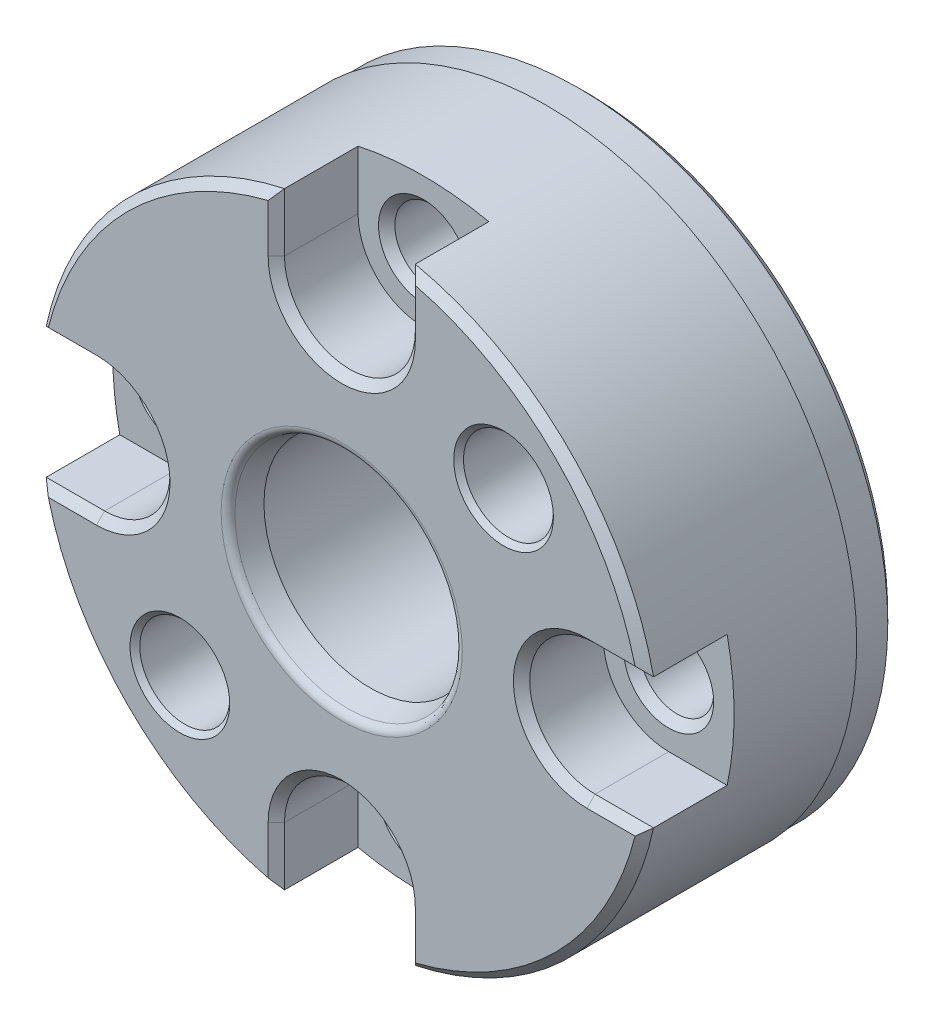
ISO-10303-21;
HEADER;
FILE_DESCRIPTION(('STEP AP214'),'2;1');
FILE_NAME('part.step','',(''),(''),'','','');
FILE_SCHEMA(('AUTOMOTIVE_DESIGN { 1 0 10303 214 1 1 1 1 }'));
ENDSEC;
DATA;
#1=APPLICATION_CONTEXT('core data for automotive mechanical design processes');
#2=APPLICATION_PROTOCOL_DEFINITION('international standard','automotive_design',2000,#1);
#3=PRODUCT_CONTEXT('',#1,'mechanical');
#4=PRODUCT('Part','Part','',(#3));
#5=PRODUCT_RELATED_PRODUCT_CATEGORY('part','',(#4));
#6=PRODUCT_DEFINITION_FORMATION('','',#4);
#7=PRODUCT_DEFINITION_CONTEXT('part definition',#1,'design');
#8=PRODUCT_DEFINITION('design','',#6,#7);
#9=PRODUCT_DEFINITION_SHAPE('','',#8);
#10=(LENGTH_UNIT() NAMED_UNIT(*) SI_UNIT(.MILLI.,.METRE.));
#11=(NAMED_UNIT(*) PLANE_ANGLE_UNIT() SI_UNIT($,.RADIAN.));
#12=(NAMED_UNIT(*) SI_UNIT($,.STERADIAN.) SOLID_ANGLE_UNIT());
#13=UNCERTAINTY_MEASURE_WITH_UNIT(LENGTH_MEASURE(1.E-05),#10,'distance_accuracy_value','');
#14=(GEOMETRIC_REPRESENTATION_CONTEXT(3) GLOBAL_UNCERTAINTY_ASSIGNED_CONTEXT((#13)) GLOBAL_UNIT_ASSIGNED_CONTEXT((#10,
#11,#12)) REPRESENTATION_CONTEXT('',''));
#15=CARTESIAN_POINT('',(0.,0.,0.));
#16=DIRECTION('',(0.,0.,1.));
#17=DIRECTION('',(1.,0.,0.));
#18=AXIS2_PLACEMENT_3D('',#15,#16,#17);
#19=CARTESIAN_POINT('',(-19.,0.,0.));
#20=DIRECTION('',(0.,0.,-1.));
#21=DIRECTION('',(-1.,0.,0.));
#22=AXIS2_PLACEMENT_3D('',#19,#20,#21);
#23=PLANE('',#22);
#24=CARTESIAN_POINT('',(0.,0.,0.));
#25=DIRECTION('',(0.,0.,-1.));
#26=DIRECTION('',(-1.,0.,0.));
#27=AXIS2_PLACEMENT_3D('',#24,#25,#26);
#28=CIRCLE('',#27,18.4);
#29=CARTESIAN_POINT('',(-18.4,0.,0.));
#30=VERTEX_POINT('',#29);
#31=EDGE_CURVE('E23',#30,#30,#28,.T.);
#32=ORIENTED_EDGE('',*,*,#31,.T.);
#33=EDGE_LOOP('',(#32));
#34=FACE_BOUND('',#33,.T.);
#35=CARTESIAN_POINT('',(9.89949493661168,9.89949493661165,0.));
#36=DIRECTION('',(0.,0.,1.));
#37=DIRECTION('',(1.,0.,0.));
#38=AXIS2_PLACEMENT_3D('',#35,#36,#37);
#39=CIRCLE('',#38,2.9);
#40=CARTESIAN_POINT('',(12.7994949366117,9.89949493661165,0.));
#41=VERTEX_POINT('',#40);
#42=EDGE_CURVE('E1058',#41,#41,#39,.T.);
#43=ORIENTED_EDGE('',*,*,#42,.T.);
#44=EDGE_LOOP('',(#43));
#45=FACE_BOUND('',#44,.T.);
#46=CARTESIAN_POINT('',(-9.89949493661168,-9.89949493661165,0.));
#47=DIRECTION('',(0.,0.,1.));
#48=DIRECTION('',(1.,0.,0.));
#49=AXIS2_PLACEMENT_3D('',#46,#47,#48);
#50=CIRCLE('',#49,2.9);
#51=CARTESIAN_POINT('',(-6.99949493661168,-9.89949493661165,0.));
#52=VERTEX_POINT('',#51);
#53=EDGE_CURVE('E1063',#52,#52,#50,.T.);
#54=ORIENTED_EDGE('',*,*,#53,.T.);
#55=EDGE_LOOP('',(#54));
#56=FACE_BOUND('',#55,.T.);
#57=CARTESIAN_POINT('',(0.,0.,0.));
#58=DIRECTION('',(0.,0.,-1.));
#59=DIRECTION('',(-1.,0.,0.));
#60=AXIS2_PLACEMENT_3D('',#57,#58,#59);
#61=CIRCLE('',#60,6.72086463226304);
#62=CARTESIAN_POINT('',(-6.72086463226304,0.,0.));
#63=VERTEX_POINT('',#62);
#64=EDGE_CURVE('E1076',#63,#63,#61,.F.);
#65=ORIENTED_EDGE('',*,*,#64,.T.);
#66=EDGE_LOOP('',(#65));
#67=FACE_BOUND('',#66,.T.);
#68=CARTESIAN_POINT('',(15.,1.06581410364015E-13,0.));
#69=DIRECTION('',(0.,0.,-1.));
#70=DIRECTION('',(-1.,0.,0.));
#71=AXIS2_PLACEMENT_3D('',#68,#69,#70);
#72=CIRCLE('',#71,2.75);
#73=CARTESIAN_POINT('',(12.25,1.06581410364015E-13,0.));
#74=VERTEX_POINT('',#73);
#75=EDGE_CURVE('E1080',#74,#74,#72,.F.);
#76=ORIENTED_EDGE('',*,*,#75,.T.);
#77=EDGE_LOOP('',(#76));
#78=FACE_BOUND('',#77,.T.);
#79=CARTESIAN_POINT('',(-1.58953630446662E-13,15.,0.));
#80=DIRECTION('',(0.,0.,-1.));
#81=DIRECTION('',(-1.,0.,0.));
#82=AXIS2_PLACEMENT_3D('',#79,#80,#81);
#83=CIRCLE('',#82,2.75);
#84=CARTESIAN_POINT('',(-2.75000000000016,15.,0.));
#85=VERTEX_POINT('',#84);
#86=EDGE_CURVE('E1084',#85,#85,#83,.F.);
#87=ORIENTED_EDGE('',*,*,#86,.T.);
#88=EDGE_LOOP('',(#87));
#89=FACE_BOUND('',#88,.T.);
#90=CARTESIAN_POINT('',(0.,-15.,0.));
#91=DIRECTION('',(0.,0.,-1.));
#92=DIRECTION('',(-1.,0.,0.));
#93=AXIS2_PLACEMENT_3D('',#90,#91,#92);
#94=CIRCLE('',#93,2.75);
#95=CARTESIAN_POINT('',(-2.74999999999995,-15.,0.));
#96=VERTEX_POINT('',#95);
#97=EDGE_CURVE('E1088',#96,#96,#94,.F.);
#98=ORIENTED_EDGE('',*,*,#97,.T.);
#99=EDGE_LOOP('',(#98));
#100=FACE_BOUND('',#99,.T.);
#101=CARTESIAN_POINT('',(-15.,0.,0.));
#102=DIRECTION('',(0.,0.,-1.));
#103=DIRECTION('',(-1.,0.,0.));
#104=AXIS2_PLACEMENT_3D('',#101,#102,#103);
#105=CIRCLE('',#104,2.75);
#106=CARTESIAN_POINT('',(-17.75,0.,0.));
#107=VERTEX_POINT('',#106);
#108=EDGE_CURVE('E1091',#107,#107,#105,.F.);
#109=ORIENTED_EDGE('',*,*,#108,.T.);
#110=EDGE_LOOP('',(#109));
#111=FACE_BOUND('',#110,.T.);
#112=ADVANCED_FACE('F14',(#34,#45,#56,#67,#78,#89,#100,#111),#23,.T.);
#113=CARTESIAN_POINT('',(0.,0.,0.));
#114=DIRECTION('',(0.,0.,1.));
#115=DIRECTION('',(1.,0.,0.));
#116=AXIS2_PLACEMENT_3D('',#113,#114,#115);
#117=CYLINDRICAL_SURFACE('',#116,4.5);
#118=CARTESIAN_POINT('',(0.,0.,2.8945896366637));
#119=DIRECTION('',(0.,0.,-1.));
#120=DIRECTION('',(-1.,0.,0.));
#121=AXIS2_PLACEMENT_3D('',#118,#119,#120);
#122=CIRCLE('',#121,4.5);
#123=CARTESIAN_POINT('',(-4.5,0.,2.8945896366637));
#124=VERTEX_POINT('',#123);
#125=EDGE_CURVE('E1125',#124,#124,#122,.T.);
#126=ORIENTED_EDGE('',*,*,#125,.T.);
#127=EDGE_LOOP('',(#126));
#128=FACE_BOUND('',#127,.T.);
#129=CARTESIAN_POINT('',(0.,0.,4.));
#130=DIRECTION('',(0.,0.,1.));
#131=DIRECTION('',(1.,0.,0.));
#132=AXIS2_PLACEMENT_3D('',#129,#130,#131);
#133=CIRCLE('',#132,4.5);
#134=CARTESIAN_POINT('',(4.5,0.,4.));
#135=VERTEX_POINT('',#134);
#136=EDGE_CURVE('E1156',#135,#135,#133,.T.);
#137=ORIENTED_EDGE('',*,*,#136,.T.);
#138=EDGE_LOOP('',(#137));
#139=FACE_BOUND('',#138,.T.);
#140=ADVANCED_FACE('F550',(#128,#139),#117,.F.);
#141=CARTESIAN_POINT('',(0.,0.,4.8));
#142=DIRECTION('',(0.,0.,1.));
#143=DIRECTION('',(1.,0.,0.));
#144=AXIS2_PLACEMENT_3D('',#141,#142,#143);
#145=PLANE('',#144);
#146=CARTESIAN_POINT('',(0.,0.,4.8));
#147=DIRECTION('',(0.,0.,1.));
#148=DIRECTION('',(1.,0.,0.));
#149=AXIS2_PLACEMENT_3D('',#146,#147,#148);
#150=CIRCLE('',#149,6.1);
#151=CARTESIAN_POINT('',(6.1,0.,4.8));
#152=VERTEX_POINT('',#151);
#153=EDGE_CURVE('E1093',#152,#152,#150,.T.);
#154=ORIENTED_EDGE('',*,*,#153,.T.);
#155=EDGE_LOOP('',(#154));
#156=FACE_BOUND('',#155,.T.);
#157=CARTESIAN_POINT('',(0.,0.,4.8));
#158=DIRECTION('',(0.,0.,1.));
#159=DIRECTION('',(1.,0.,0.));
#160=AXIS2_PLACEMENT_3D('',#157,#158,#159);
#161=CIRCLE('',#160,5.3);
#162=CARTESIAN_POINT('',(5.3,0.,4.8));
#163=VERTEX_POINT('',#162);
#164=EDGE_CURVE('E370',#163,#163,#161,.F.);
#165=ORIENTED_EDGE('',*,*,#164,.T.);
#166=EDGE_LOOP('',(#165));
#167=FACE_BOUND('',#166,.T.);
#168=ADVANCED_FACE('F556',(#156,#167),#145,.T.);
#169=CARTESIAN_POINT('',(0.,0.,0.));
#170=DIRECTION('',(0.,0.,-1.));
#171=DIRECTION('',(-1.,0.,0.));
#172=AXIS2_PLACEMENT_3D('',#169,#170,#171);
#173=CYLINDRICAL_SURFACE('',#172,19.);
#174=CARTESIAN_POINT('',(0.,0.,2.5));
#175=DIRECTION('',(0.,0.,-1.));
#176=DIRECTION('',(-1.,0.,0.));
#177=AXIS2_PLACEMENT_3D('',#174,#175,#176);
#178=CIRCLE('',#177,19.);
#179=CARTESIAN_POINT('',(-19.,0.,2.5));
#180=VERTEX_POINT('',#179);
#181=EDGE_CURVE('E1052',#180,#180,#178,.T.);
#182=ORIENTED_EDGE('',*,*,#181,.F.);
#183=EDGE_LOOP('',(#182));
#184=FACE_BOUND('',#183,.T.);
#185=DIRECTION('',(0.,0.,1.));
#186=VECTOR('',#185,1.);
#187=CARTESIAN_POINT('',(3.99999999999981,18.5741756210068,10.));
#188=LINE('',#187,#186);
#189=CARTESIAN_POINT('',(3.99999999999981,18.5741756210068,10.));
#190=VERTEX_POINT('',#189);
#191=CARTESIAN_POINT('',(3.99999999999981,18.5741756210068,14.5));
#192=VERTEX_POINT('',#191);
#193=EDGE_CURVE('E184',#190,#192,#188,.T.);
#194=ORIENTED_EDGE('',*,*,#193,.T.);
#195=CARTESIAN_POINT('',(0.,0.,14.5));
#196=DIRECTION('',(0.,0.,1.));
#197=DIRECTION('',(1.,0.,0.));
#198=AXIS2_PLACEMENT_3D('',#195,#196,#197);
#199=CIRCLE('',#198,19.);
#200=CARTESIAN_POINT('',(18.5741756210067,4.00000000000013,14.5));
#201=VERTEX_POINT('',#200);
#202=EDGE_CURVE('E312',#192,#201,#199,.F.);
#203=ORIENTED_EDGE('',*,*,#202,.T.);
#204=DIRECTION('',(0.,0.,1.));
#205=VECTOR('',#204,1.);
#206=CARTESIAN_POINT('',(18.5741756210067,4.00000000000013,10.));
#207=LINE('',#206,#205);
#208=CARTESIAN_POINT('',(18.5741756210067,4.00000000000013,10.));
#209=VERTEX_POINT('',#208);
#210=EDGE_CURVE('E229',#209,#201,#207,.T.);
#211=ORIENTED_EDGE('',*,*,#210,.F.);
#212=CARTESIAN_POINT('',(0.,0.,10.));
#213=DIRECTION('',(0.,0.,1.));
#214=DIRECTION('',(-1.,0.,0.));
#215=AXIS2_PLACEMENT_3D('',#212,#213,#214);
#216=CIRCLE('',#215,19.);
#217=CARTESIAN_POINT('',(18.5741756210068,-3.99999999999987,10.));
#218=VERTEX_POINT('',#217);
#219=EDGE_CURVE('E219',#218,#209,#216,.T.);
#220=ORIENTED_EDGE('',*,*,#219,.F.);
#221=DIRECTION('',(0.,0.,1.));
#222=VECTOR('',#221,1.);
#223=CARTESIAN_POINT('',(18.5741756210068,-3.99999999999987,10.));
#224=LINE('',#223,#222);
#225=CARTESIAN_POINT('',(18.5741756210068,-3.99999999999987,14.5));
#226=VERTEX_POINT('',#225);
#227=EDGE_CURVE('E232',#218,#226,#224,.T.);
#228=ORIENTED_EDGE('',*,*,#227,.T.);
#229=CARTESIAN_POINT('',(0.,0.,14.5));
#230=DIRECTION('',(0.,0.,1.));
#231=DIRECTION('',(1.,0.,0.));
#232=AXIS2_PLACEMENT_3D('',#229,#230,#231);
#233=CIRCLE('',#232,19.);
#234=CARTESIAN_POINT('',(4.00000000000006,-18.5741756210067,14.5));
#235=VERTEX_POINT('',#234);
#236=EDGE_CURVE('E310',#226,#235,#233,.F.);
#237=ORIENTED_EDGE('',*,*,#236,.T.);
#238=DIRECTION('',(0.,0.,1.));
#239=VECTOR('',#238,1.);
#240=CARTESIAN_POINT('',(4.00000000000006,-18.5741756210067,10.));
#241=LINE('',#240,#239);
#242=CARTESIAN_POINT('',(4.00000000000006,-18.5741756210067,10.));
#243=VERTEX_POINT('',#242);
#244=EDGE_CURVE('E252',#243,#235,#241,.T.);
#245=ORIENTED_EDGE('',*,*,#244,.F.);
#246=CARTESIAN_POINT('',(0.,0.,10.));
#247=DIRECTION('',(0.,0.,1.));
#248=DIRECTION('',(0.,1.,0.));
#249=AXIS2_PLACEMENT_3D('',#246,#247,#248);
#250=CIRCLE('',#249,19.);
#251=CARTESIAN_POINT('',(-3.99999999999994,-18.5741756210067,10.));
#252=VERTEX_POINT('',#251);
#253=EDGE_CURVE('E242',#252,#243,#250,.T.);
#254=ORIENTED_EDGE('',*,*,#253,.F.);
#255=DIRECTION('',(0.,0.,1.));
#256=VECTOR('',#255,1.);
#257=CARTESIAN_POINT('',(-3.99999999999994,-18.5741756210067,10.));
#258=LINE('',#257,#256);
#259=CARTESIAN_POINT('',(-3.99999999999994,-18.5741756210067,14.5));
#260=VERTEX_POINT('',#259);
#261=EDGE_CURVE('E255',#252,#260,#258,.T.);
#262=ORIENTED_EDGE('',*,*,#261,.T.);
#263=CARTESIAN_POINT('',(0.,0.,14.5));
#264=DIRECTION('',(0.,0.,1.));
#265=DIRECTION('',(1.,0.,0.));
#266=AXIS2_PLACEMENT_3D('',#263,#264,#265);
#267=CIRCLE('',#266,19.);
#268=CARTESIAN_POINT('',(-18.5741756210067,-4.,14.5));
#269=VERTEX_POINT('',#268);
#270=EDGE_CURVE('E308',#260,#269,#267,.F.);
#271=ORIENTED_EDGE('',*,*,#270,.T.);
#272=DIRECTION('',(0.,0.,1.));
#273=VECTOR('',#272,1.);
#274=CARTESIAN_POINT('',(-18.5741756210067,-4.,10.));
#275=LINE('',#274,#273);
#276=CARTESIAN_POINT('',(-18.5741756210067,-4.,10.));
#277=VERTEX_POINT('',#276);
#278=EDGE_CURVE('E275',#277,#269,#275,.T.);
#279=ORIENTED_EDGE('',*,*,#278,.F.);
#280=CARTESIAN_POINT('',(0.,0.,10.));
#281=DIRECTION('',(0.,0.,1.));
#282=DIRECTION('',(1.,0.,0.));
#283=AXIS2_PLACEMENT_3D('',#280,#281,#282);
#284=CIRCLE('',#283,19.);
#285=CARTESIAN_POINT('',(-18.5741756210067,4.,10.));
#286=VERTEX_POINT('',#285);
#287=EDGE_CURVE('E265',#286,#277,#284,.T.);
#288=ORIENTED_EDGE('',*,*,#287,.F.);
#289=DIRECTION('',(0.,0.,1.));
#290=VECTOR('',#289,1.);
#291=CARTESIAN_POINT('',(-18.5741756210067,4.,10.));
#292=LINE('',#291,#290);
#293=CARTESIAN_POINT('',(-18.5741756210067,4.,14.5));
#294=VERTEX_POINT('',#293);
#295=EDGE_CURVE('E278',#286,#294,#292,.T.);
#296=ORIENTED_EDGE('',*,*,#295,.T.);
#297=CARTESIAN_POINT('',(0.,0.,14.5));
#298=DIRECTION('',(0.,0.,1.));
#299=DIRECTION('',(1.,0.,0.));
#300=AXIS2_PLACEMENT_3D('',#297,#298,#299);
#301=CIRCLE('',#300,19.);
#302=CARTESIAN_POINT('',(-4.00000000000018,18.5741756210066,14.5));
#303=VERTEX_POINT('',#302);
#304=EDGE_CURVE('E306',#294,#303,#301,.F.);
#305=ORIENTED_EDGE('',*,*,#304,.T.);
#306=DIRECTION('',(0.,0.,1.));
#307=VECTOR('',#306,1.);
#308=CARTESIAN_POINT('',(-4.00000000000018,18.5741756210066,10.));
#309=LINE('',#308,#307);
#310=CARTESIAN_POINT('',(-4.00000000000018,18.5741756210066,10.));
#311=VERTEX_POINT('',#310);
#312=EDGE_CURVE('E211',#311,#303,#309,.T.);
#313=ORIENTED_EDGE('',*,*,#312,.F.);
#314=CARTESIAN_POINT('',(0.,0.,10.));
#315=DIRECTION('',(0.,0.,1.));
#316=DIRECTION('',(0.,-1.,0.));
#317=AXIS2_PLACEMENT_3D('',#314,#315,#316);
#318=CIRCLE('',#317,19.);
#319=EDGE_CURVE('E193',#190,#311,#318,.T.);
#320=ORIENTED_EDGE('',*,*,#319,.F.);
#321=EDGE_LOOP('',(#194,#203,#211,#220,#228,#237,#245,#254,#262,#271,#279,#288,#296,#305,#313,#320));
#322=FACE_BOUND('',#321,.T.);
#323=ADVANCED_FACE('F563',(#184,#322),#173,.T.);
#324=CARTESIAN_POINT('',(-19.,0.,15.));
#325=DIRECTION('',(0.,0.,1.));
#326=DIRECTION('',(1.,0.,0.));
#327=AXIS2_PLACEMENT_3D('',#324,#325,#326);
#328=PLANE('',#327);
#329=CARTESIAN_POINT('',(-9.89949493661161,-9.89949493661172,15.));
#330=DIRECTION('',(0.,0.,1.));
#331=DIRECTION('',(1.,0.,0.));
#332=AXIS2_PLACEMENT_3D('',#329,#330,#331);
#333=CIRCLE('',#332,3.05);
#334=CARTESIAN_POINT('',(-6.84949493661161,-9.89949493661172,15.));
#335=VERTEX_POINT('',#334);
#336=EDGE_CURVE('E675',#335,#335,#333,.F.);
#337=ORIENTED_EDGE('',*,*,#336,.T.);
#338=EDGE_LOOP('',(#337));
#339=FACE_BOUND('',#338,.T.);
#340=CARTESIAN_POINT('',(9.89949493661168,9.89949493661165,15.));
#341=DIRECTION('',(0.,0.,1.));
#342=DIRECTION('',(1.,0.,0.));
#343=AXIS2_PLACEMENT_3D('',#340,#341,#342);
#344=CIRCLE('',#343,3.05);
#345=CARTESIAN_POINT('',(12.9494949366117,9.89949493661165,15.));
#346=VERTEX_POINT('',#345);
#347=EDGE_CURVE('E678',#346,#346,#344,.F.);
#348=ORIENTED_EDGE('',*,*,#347,.T.);
#349=EDGE_LOOP('',(#348));
#350=FACE_BOUND('',#349,.T.);
#351=CARTESIAN_POINT('',(0.,0.,15.));
#352=DIRECTION('',(0.,0.,1.));
#353=DIRECTION('',(1.,0.,0.));
#354=AXIS2_PLACEMENT_3D('',#351,#352,#353);
#355=CIRCLE('',#354,7.3767770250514);
#356=CARTESIAN_POINT('',(7.3767770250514,0.,15.));
#357=VERTEX_POINT('',#356);
#358=EDGE_CURVE('E682',#357,#357,#355,.F.);
#359=ORIENTED_EDGE('',*,*,#358,.T.);
#360=EDGE_LOOP('',(#359));
#361=FACE_BOUND('',#360,.T.);
#362=DIRECTION('',(1.,0.,0.));
#363=VECTOR('',#362,1.);
#364=CARTESIAN_POINT('',(18.5741756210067,4.50000000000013,15.));
#365=LINE('',#364,#363);
#366=CARTESIAN_POINT('',(15.,4.50000000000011,15.));
#367=VERTEX_POINT('',#366);
#368=CARTESIAN_POINT('',(17.9443584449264,4.50000000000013,15.));
#369=VERTEX_POINT('',#368);
#370=EDGE_CURVE('E343',#367,#369,#365,.T.);
#371=ORIENTED_EDGE('',*,*,#370,.T.);
#372=CARTESIAN_POINT('',(0.,0.,15.));
#373=DIRECTION('',(0.,0.,1.));
#374=DIRECTION('',(1.,0.,0.));
#375=AXIS2_PLACEMENT_3D('',#372,#373,#374);
#376=CIRCLE('',#375,18.5);
#377=CARTESIAN_POINT('',(4.49999999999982,17.9443584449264,15.));
#378=VERTEX_POINT('',#377);
#379=EDGE_CURVE('E345',#369,#378,#376,.T.);
#380=ORIENTED_EDGE('',*,*,#379,.T.);
#381=DIRECTION('',(0.,-1.,0.));
#382=VECTOR('',#381,1.);
#383=CARTESIAN_POINT('',(4.49999999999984,15.,15.));
#384=LINE('',#383,#382);
#385=CARTESIAN_POINT('',(4.49999999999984,15.,15.));
#386=VERTEX_POINT('',#385);
#387=EDGE_CURVE('E317',#378,#386,#384,.T.);
#388=ORIENTED_EDGE('',*,*,#387,.T.);
#389=CARTESIAN_POINT('',(-1.58953630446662E-13,15.,15.));
#390=DIRECTION('',(0.,0.,1.));
#391=DIRECTION('',(1.,0.,0.));
#392=AXIS2_PLACEMENT_3D('',#389,#390,#391);
#393=CIRCLE('',#392,4.5);
#394=CARTESIAN_POINT('',(-4.50000000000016,15.,15.));
#395=VERTEX_POINT('',#394);
#396=EDGE_CURVE('E315',#386,#395,#393,.F.);
#397=ORIENTED_EDGE('',*,*,#396,.T.);
#398=DIRECTION('',(0.,1.,0.));
#399=VECTOR('',#398,1.);
#400=CARTESIAN_POINT('',(-4.5000000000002,18.5741756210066,15.));
#401=LINE('',#400,#399);
#402=CARTESIAN_POINT('',(-4.50000000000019,17.9443584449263,15.));
#403=VERTEX_POINT('',#402);
#404=EDGE_CURVE('E319',#395,#403,#401,.T.);
#405=ORIENTED_EDGE('',*,*,#404,.T.);
#406=CARTESIAN_POINT('',(0.,0.,15.));
#407=DIRECTION('',(0.,0.,1.));
#408=DIRECTION('',(1.,0.,0.));
#409=AXIS2_PLACEMENT_3D('',#406,#407,#408);
#410=CIRCLE('',#409,18.5);
#411=CARTESIAN_POINT('',(-17.9443584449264,4.5,15.));
#412=VERTEX_POINT('',#411);
#413=EDGE_CURVE('E321',#403,#412,#410,.T.);
#414=ORIENTED_EDGE('',*,*,#413,.T.);
#415=DIRECTION('',(1.,0.,0.));
#416=VECTOR('',#415,1.);
#417=CARTESIAN_POINT('',(-15.,4.5,15.));
#418=LINE('',#417,#416);
#419=CARTESIAN_POINT('',(-15.,4.5,15.));
#420=VERTEX_POINT('',#419);
#421=EDGE_CURVE('E323',#412,#420,#418,.T.);
#422=ORIENTED_EDGE('',*,*,#421,.T.);
#423=CARTESIAN_POINT('',(-15.,0.,15.));
#424=DIRECTION('',(0.,0.,1.));
#425=DIRECTION('',(1.,0.,0.));
#426=AXIS2_PLACEMENT_3D('',#423,#424,#425);
#427=CIRCLE('',#426,4.5);
#428=CARTESIAN_POINT('',(-15.,-4.5,15.));
#429=VERTEX_POINT('',#428);
#430=EDGE_CURVE('E325',#420,#429,#427,.F.);
#431=ORIENTED_EDGE('',*,*,#430,.T.);
#432=DIRECTION('',(-1.,0.,0.));
#433=VECTOR('',#432,1.);
#434=CARTESIAN_POINT('',(-18.5741756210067,-4.5,15.));
#435=LINE('',#434,#433);
#436=CARTESIAN_POINT('',(-17.9443584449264,-4.5,15.));
#437=VERTEX_POINT('',#436);
#438=EDGE_CURVE('E327',#429,#437,#435,.T.);
#439=ORIENTED_EDGE('',*,*,#438,.T.);
#440=CARTESIAN_POINT('',(0.,0.,15.));
#441=DIRECTION('',(0.,0.,1.));
#442=DIRECTION('',(1.,0.,0.));
#443=AXIS2_PLACEMENT_3D('',#440,#441,#442);
#444=CIRCLE('',#443,18.5);
#445=CARTESIAN_POINT('',(-4.49999999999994,-17.9443584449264,15.));
#446=VERTEX_POINT('',#445);
#447=EDGE_CURVE('E329',#437,#446,#444,.T.);
#448=ORIENTED_EDGE('',*,*,#447,.T.);
#449=DIRECTION('',(0.,1.,0.));
#450=VECTOR('',#449,1.);
#451=CARTESIAN_POINT('',(-4.49999999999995,-15.,15.));
#452=LINE('',#451,#450);
#453=CARTESIAN_POINT('',(-4.49999999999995,-15.,15.));
#454=VERTEX_POINT('',#453);
#455=EDGE_CURVE('E331',#446,#454,#452,.T.);
#456=ORIENTED_EDGE('',*,*,#455,.T.);
#457=CARTESIAN_POINT('',(0.,-15.,15.));
#458=DIRECTION('',(0.,0.,1.));
#459=DIRECTION('',(1.,0.,0.));
#460=AXIS2_PLACEMENT_3D('',#457,#458,#459);
#461=CIRCLE('',#460,4.5);
#462=CARTESIAN_POINT('',(4.50000000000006,-15.,15.));
#463=VERTEX_POINT('',#462);
#464=EDGE_CURVE('E333',#454,#463,#461,.F.);
#465=ORIENTED_EDGE('',*,*,#464,.T.);
#466=DIRECTION('',(0.,-1.,0.));
#467=VECTOR('',#466,1.);
#468=CARTESIAN_POINT('',(4.50000000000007,-18.5741756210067,15.));
#469=LINE('',#468,#467);
#470=CARTESIAN_POINT('',(4.50000000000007,-17.9443584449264,15.));
#471=VERTEX_POINT('',#470);
#472=EDGE_CURVE('E335',#463,#471,#469,.T.);
#473=ORIENTED_EDGE('',*,*,#472,.T.);
#474=CARTESIAN_POINT('',(0.,0.,15.));
#475=DIRECTION('',(0.,0.,1.));
#476=DIRECTION('',(1.,0.,0.));
#477=AXIS2_PLACEMENT_3D('',#474,#475,#476);
#478=CIRCLE('',#477,18.5);
#479=CARTESIAN_POINT('',(17.9443584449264,-4.49999999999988,15.));
#480=VERTEX_POINT('',#479);
#481=EDGE_CURVE('E337',#471,#480,#478,.T.);
#482=ORIENTED_EDGE('',*,*,#481,.T.);
#483=DIRECTION('',(-1.,0.,0.));
#484=VECTOR('',#483,1.);
#485=CARTESIAN_POINT('',(15.,-4.4999999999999,15.));
#486=LINE('',#485,#484);
#487=CARTESIAN_POINT('',(15.,-4.4999999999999,15.));
#488=VERTEX_POINT('',#487);
#489=EDGE_CURVE('E339',#480,#488,#486,.T.);
#490=ORIENTED_EDGE('',*,*,#489,.T.);
#491=CARTESIAN_POINT('',(15.,1.06581410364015E-13,15.));
#492=DIRECTION('',(0.,0.,1.));
#493=DIRECTION('',(1.,0.,0.));
#494=AXIS2_PLACEMENT_3D('',#491,#492,#493);
#495=CIRCLE('',#494,4.5);
#496=EDGE_CURVE('E341',#488,#367,#495,.F.);
#497=ORIENTED_EDGE('',*,*,#496,.T.);
#498=EDGE_LOOP('',(#371,#380,#388,#397,#405,#414,#422,#431,#439,#448,#456,#465,#473,#482,#490,#497));
#499=FACE_BOUND('',#498,.T.);
#500=ADVANCED_FACE('F664',(#339,#350,#361,#499),#328,.T.);
#501=CARTESIAN_POINT('',(-15.,0.,10.));
#502=DIRECTION('',(0.,0.,1.));
#503=DIRECTION('',(1.,0.,0.));
#504=AXIS2_PLACEMENT_3D('',#501,#502,#503);
#505=CYLINDRICAL_SURFACE('',#504,4.);
#506=DIRECTION('',(0.,0.,1.));
#507=VECTOR('',#506,1.);
#508=CARTESIAN_POINT('',(-15.,-4.,10.));
#509=LINE('',#508,#507);
#510=CARTESIAN_POINT('',(-15.,-4.,10.));
#511=VERTEX_POINT('',#510);
#512=CARTESIAN_POINT('',(-15.,-4.,14.5));
#513=VERTEX_POINT('',#512);
#514=EDGE_CURVE('E271',#511,#513,#509,.T.);
#515=ORIENTED_EDGE('',*,*,#514,.T.);
#516=CARTESIAN_POINT('',(-15.,0.,14.5));
#517=DIRECTION('',(0.,0.,1.));
#518=DIRECTION('',(1.,0.,0.));
#519=AXIS2_PLACEMENT_3D('',#516,#517,#518);
#520=CIRCLE('',#519,4.);
#521=CARTESIAN_POINT('',(-15.,4.,14.5));
#522=VERTEX_POINT('',#521);
#523=EDGE_CURVE('E362',#513,#522,#520,.T.);
#524=ORIENTED_EDGE('',*,*,#523,.T.);
#525=DIRECTION('',(0.,0.,1.));
#526=VECTOR('',#525,1.);
#527=CARTESIAN_POINT('',(-15.,4.,10.));
#528=LINE('',#527,#526);
#529=CARTESIAN_POINT('',(-15.,4.,10.));
#530=VERTEX_POINT('',#529);
#531=EDGE_CURVE('E270',#530,#522,#528,.T.);
#532=ORIENTED_EDGE('',*,*,#531,.F.);
#533=CARTESIAN_POINT('',(-15.,0.,10.));
#534=DIRECTION('',(0.,0.,1.));
#535=DIRECTION('',(1.,0.,0.));
#536=AXIS2_PLACEMENT_3D('',#533,#534,#535);
#537=CIRCLE('',#536,4.);
#538=EDGE_CURVE('E251',#511,#530,#537,.T.);
#539=ORIENTED_EDGE('',*,*,#538,.F.);
#540=EDGE_LOOP('',(#515,#524,#532,#539));
#541=FACE_BOUND('',#540,.T.);
#542=ADVANCED_FACE('F658',(#541),#505,.F.);
#543=CARTESIAN_POINT('',(-15.,-4.,10.));
#544=DIRECTION('',(0.,-1.,0.));
#545=DIRECTION('',(0.,0.,-1.));
#546=AXIS2_PLACEMENT_3D('',#543,#544,#545);
#547=PLANE('',#546);
#548=ORIENTED_EDGE('',*,*,#278,.T.);
#549=DIRECTION('',(1.,0.,0.));
#550=VECTOR('',#549,1.);
#551=CARTESIAN_POINT('',(-15.,-4.,14.5));
#552=LINE('',#551,#550);
#553=EDGE_CURVE('E360',#269,#513,#552,.T.);
#554=ORIENTED_EDGE('',*,*,#553,.T.);
#555=ORIENTED_EDGE('',*,*,#514,.F.);
#556=DIRECTION('',(1.,0.,0.));
#557=VECTOR('',#556,1.);
#558=CARTESIAN_POINT('',(-15.,-4.,10.));
#559=LINE('',#558,#557);
#560=EDGE_CURVE('E267',#277,#511,#559,.T.);
#561=ORIENTED_EDGE('',*,*,#560,.F.);
#562=EDGE_LOOP('',(#548,#554,#555,#561));
#563=FACE_BOUND('',#562,.T.);
#564=ADVANCED_FACE('F655',(#563),#547,.F.);
#565=CARTESIAN_POINT('',(-15.,4.,10.));
#566=DIRECTION('',(0.,1.,0.));
#567=DIRECTION('',(0.,0.,1.));
#568=AXIS2_PLACEMENT_3D('',#565,#566,#567);
#569=PLANE('',#568);
#570=ORIENTED_EDGE('',*,*,#531,.T.);
#571=DIRECTION('',(-1.,0.,0.));
#572=VECTOR('',#571,1.);
#573=CARTESIAN_POINT('',(-18.5741756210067,4.,14.5));
#574=LINE('',#573,#572);
#575=EDGE_CURVE('E364',#522,#294,#574,.T.);
#576=ORIENTED_EDGE('',*,*,#575,.T.);
#577=ORIENTED_EDGE('',*,*,#295,.F.);
#578=DIRECTION('',(-1.,0.,0.));
#579=VECTOR('',#578,1.);
#580=CARTESIAN_POINT('',(-15.,4.,10.));
#581=LINE('',#580,#579);
#582=EDGE_CURVE('E262',#530,#286,#581,.T.);
#583=ORIENTED_EDGE('',*,*,#582,.F.);
#584=EDGE_LOOP('',(#570,#576,#577,#583));
#585=FACE_BOUND('',#584,.T.);
#586=ADVANCED_FACE('F653',(#585),#569,.F.);
#587=CARTESIAN_POINT('',(-15.,0.,10.));
#588=DIRECTION('',(0.,0.,1.));
#589=DIRECTION('',(1.,0.,0.));
#590=AXIS2_PLACEMENT_3D('',#587,#588,#589);
#591=PLANE('',#590);
#592=CARTESIAN_POINT('',(-15.,0.,10.));
#593=DIRECTION('',(0.,0.,1.));
#594=DIRECTION('',(1.,0.,0.));
#595=AXIS2_PLACEMENT_3D('',#592,#593,#594);
#596=CIRCLE('',#595,2.75);
#597=CARTESIAN_POINT('',(-12.25,0.,10.));
#598=VERTEX_POINT('',#597);
#599=EDGE_CURVE('E285',#598,#598,#596,.F.);
#600=ORIENTED_EDGE('',*,*,#599,.T.);
#601=EDGE_LOOP('',(#600));
#602=FACE_BOUND('',#601,.T.);
#603=ORIENTED_EDGE('',*,*,#538,.T.);
#604=ORIENTED_EDGE('',*,*,#582,.T.);
#605=ORIENTED_EDGE('',*,*,#287,.T.);
#606=ORIENTED_EDGE('',*,*,#560,.T.);
#607=EDGE_LOOP('',(#603,#604,#605,#606));
#608=FACE_BOUND('',#607,.T.);
#609=ADVANCED_FACE('F649',(#602,#608),#591,.T.);
#610=CARTESIAN_POINT('',(-15.,0.,0.));
#611=DIRECTION('',(0.,0.,1.));
#612=DIRECTION('',(1.,0.,0.));
#613=AXIS2_PLACEMENT_3D('',#610,#611,#612);
#614=CYLINDRICAL_SURFACE('',#613,2.25);
#615=CARTESIAN_POINT('',(-15.,0.,0.500000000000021));
#616=DIRECTION('',(0.,0.,-1.));
#617=DIRECTION('',(-1.,0.,0.));
#618=AXIS2_PLACEMENT_3D('',#615,#616,#617);
#619=CIRCLE('',#618,2.25);
#620=CARTESIAN_POINT('',(-17.25,0.,0.500000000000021));
#621=VERTEX_POINT('',#620);
#622=EDGE_CURVE('E1111',#621,#621,#619,.T.);
#623=ORIENTED_EDGE('',*,*,#622,.T.);
#624=EDGE_LOOP('',(#623));
#625=FACE_BOUND('',#624,.T.);
#626=CARTESIAN_POINT('',(-15.,0.,9.5));
#627=DIRECTION('',(0.,0.,1.));
#628=DIRECTION('',(1.,0.,0.));
#629=AXIS2_PLACEMENT_3D('',#626,#627,#628);
#630=CIRCLE('',#629,2.25);
#631=CARTESIAN_POINT('',(-12.75,0.,9.5));
#632=VERTEX_POINT('',#631);
#633=EDGE_CURVE('E274',#632,#632,#630,.T.);
#634=ORIENTED_EDGE('',*,*,#633,.T.);
#635=EDGE_LOOP('',(#634));
#636=FACE_BOUND('',#635,.T.);
#637=ADVANCED_FACE('F572',(#625,#636),#614,.F.);
#638=CARTESIAN_POINT('',(-15.,0.,9.5));
#639=DIRECTION('',(0.,0.,1.));
#640=DIRECTION('',(1.,0.,0.));
#641=AXIS2_PLACEMENT_3D('',#638,#639,#640);
#642=CONICAL_SURFACE('',#641,2.25,0.785398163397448);
#643=ORIENTED_EDGE('',*,*,#599,.F.);
#644=EDGE_LOOP('',(#643));
#645=FACE_BOUND('',#644,.T.);
#646=ORIENTED_EDGE('',*,*,#633,.F.);
#647=EDGE_LOOP('',(#646));
#648=FACE_BOUND('',#647,.T.);
#649=ADVANCED_FACE('F568',(#645,#648),#642,.F.);
#650=CARTESIAN_POINT('',(0.,-15.,10.));
#651=DIRECTION('',(0.,0.,1.));
#652=DIRECTION('',(1.,0.,0.));
#653=AXIS2_PLACEMENT_3D('',#650,#651,#652);
#654=CYLINDRICAL_SURFACE('',#653,4.);
#655=DIRECTION('',(0.,0.,1.));
#656=VECTOR('',#655,1.);
#657=CARTESIAN_POINT('',(4.00000000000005,-15.,10.));
#658=LINE('',#657,#656);
#659=CARTESIAN_POINT('',(4.00000000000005,-15.,10.));
#660=VERTEX_POINT('',#659);
#661=CARTESIAN_POINT('',(4.00000000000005,-15.,14.5));
#662=VERTEX_POINT('',#661);
#663=EDGE_CURVE('E248',#660,#662,#658,.T.);
#664=ORIENTED_EDGE('',*,*,#663,.T.);
#665=CARTESIAN_POINT('',(0.,-15.,14.5));
#666=DIRECTION('',(0.,0.,1.));
#667=DIRECTION('',(1.,0.,0.));
#668=AXIS2_PLACEMENT_3D('',#665,#666,#667);
#669=CIRCLE('',#668,4.);
#670=CARTESIAN_POINT('',(-3.99999999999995,-15.,14.5));
#671=VERTEX_POINT('',#670);
#672=EDGE_CURVE('E356',#662,#671,#669,.T.);
#673=ORIENTED_EDGE('',*,*,#672,.T.);
#674=DIRECTION('',(0.,0.,1.));
#675=VECTOR('',#674,1.);
#676=CARTESIAN_POINT('',(-3.99999999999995,-15.,10.));
#677=LINE('',#676,#675);
#678=CARTESIAN_POINT('',(-3.99999999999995,-15.,10.));
#679=VERTEX_POINT('',#678);
#680=EDGE_CURVE('E247',#679,#671,#677,.T.);
#681=ORIENTED_EDGE('',*,*,#680,.F.);
#682=CARTESIAN_POINT('',(0.,-15.,10.));
#683=DIRECTION('',(0.,0.,1.));
#684=DIRECTION('',(0.,1.,0.));
#685=AXIS2_PLACEMENT_3D('',#682,#683,#684);
#686=CIRCLE('',#685,4.);
#687=EDGE_CURVE('E228',#660,#679,#686,.T.);
#688=ORIENTED_EDGE('',*,*,#687,.F.);
#689=EDGE_LOOP('',(#664,#673,#681,#688));
#690=FACE_BOUND('',#689,.T.);
#691=ADVANCED_FACE('F571',(#690),#654,.F.);
#692=CARTESIAN_POINT('',(4.00000000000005,-15.,10.));
#693=DIRECTION('',(1.,0.,0.));
#694=DIRECTION('',(0.,1.,0.));
#695=AXIS2_PLACEMENT_3D('',#692,#693,#694);
#696=PLANE('',#695);
#697=ORIENTED_EDGE('',*,*,#244,.T.);
#698=DIRECTION('',(0.,1.,0.));
#699=VECTOR('',#698,1.);
#700=CARTESIAN_POINT('',(4.00000000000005,-15.,14.5));
#701=LINE('',#700,#699);
#702=EDGE_CURVE('E354',#235,#662,#701,.T.);
#703=ORIENTED_EDGE('',*,*,#702,.T.);
#704=ORIENTED_EDGE('',*,*,#663,.F.);
#705=DIRECTION('',(0.,1.,0.));
#706=VECTOR('',#705,1.);
#707=CARTESIAN_POINT('',(4.00000000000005,-15.,10.));
#708=LINE('',#707,#706);
#709=EDGE_CURVE('E244',#243,#660,#708,.T.);
#710=ORIENTED_EDGE('',*,*,#709,.F.);
#711=EDGE_LOOP('',(#697,#703,#704,#710));
#712=FACE_BOUND('',#711,.T.);
#713=ADVANCED_FACE('F637',(#712),#696,.F.);
#714=CARTESIAN_POINT('',(-3.99999999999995,-15.,10.));
#715=DIRECTION('',(-1.,0.,0.));
#716=DIRECTION('',(0.,-1.,0.));
#717=AXIS2_PLACEMENT_3D('',#714,#715,#716);
#718=PLANE('',#717);
#719=ORIENTED_EDGE('',*,*,#680,.T.);
#720=DIRECTION('',(0.,-1.,0.));
#721=VECTOR('',#720,1.);
#722=CARTESIAN_POINT('',(-3.99999999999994,-18.5741756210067,14.5));
#723=LINE('',#722,#721);
#724=EDGE_CURVE('E358',#671,#260,#723,.T.);
#725=ORIENTED_EDGE('',*,*,#724,.T.);
#726=ORIENTED_EDGE('',*,*,#261,.F.);
#727=DIRECTION('',(0.,-1.,0.));
#728=VECTOR('',#727,1.);
#729=CARTESIAN_POINT('',(-3.99999999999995,-15.,10.));
#730=LINE('',#729,#728);
#731=EDGE_CURVE('E239',#679,#252,#730,.T.);
#732=ORIENTED_EDGE('',*,*,#731,.F.);
#733=EDGE_LOOP('',(#719,#725,#726,#732));
#734=FACE_BOUND('',#733,.T.);
#735=ADVANCED_FACE('F635',(#734),#718,.F.);
#736=CARTESIAN_POINT('',(0.,-15.,10.));
#737=DIRECTION('',(0.,0.,1.));
#738=DIRECTION('',(0.,1.,0.));
#739=AXIS2_PLACEMENT_3D('',#736,#737,#738);
#740=PLANE('',#739);
#741=CARTESIAN_POINT('',(0.,-15.,10.));
#742=DIRECTION('',(0.,0.,1.));
#743=DIRECTION('',(1.,0.,0.));
#744=AXIS2_PLACEMENT_3D('',#741,#742,#743);
#745=CIRCLE('',#744,2.75);
#746=CARTESIAN_POINT('',(2.75000000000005,-15.,10.));
#747=VERTEX_POINT('',#746);
#748=EDGE_CURVE('E291',#747,#747,#745,.F.);
#749=ORIENTED_EDGE('',*,*,#748,.T.);
#750=EDGE_LOOP('',(#749));
#751=FACE_BOUND('',#750,.T.);
#752=ORIENTED_EDGE('',*,*,#687,.T.);
#753=ORIENTED_EDGE('',*,*,#731,.T.);
#754=ORIENTED_EDGE('',*,*,#253,.T.);
#755=ORIENTED_EDGE('',*,*,#709,.T.);
#756=EDGE_LOOP('',(#752,#753,#754,#755));
#757=FACE_BOUND('',#756,.T.);
#758=ADVANCED_FACE('F631',(#751,#757),#740,.T.);
#759=CARTESIAN_POINT('',(15.,1.06581410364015E-13,10.));
#760=DIRECTION('',(0.,0.,1.));
#761=DIRECTION('',(1.,0.,0.));
#762=AXIS2_PLACEMENT_3D('',#759,#760,#761);
#763=CYLINDRICAL_SURFACE('',#762,4.);
#764=DIRECTION('',(0.,0.,1.));
#765=VECTOR('',#764,1.);
#766=CARTESIAN_POINT('',(15.,4.0000000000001,10.));
#767=LINE('',#766,#765);
#768=CARTESIAN_POINT('',(15.,4.0000000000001,10.));
#769=VERTEX_POINT('',#768);
#770=CARTESIAN_POINT('',(15.,4.0000000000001,14.5));
#771=VERTEX_POINT('',#770);
#772=EDGE_CURVE('E225',#769,#771,#767,.T.);
#773=ORIENTED_EDGE('',*,*,#772,.T.);
#774=CARTESIAN_POINT('',(15.,1.06581410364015E-13,14.5));
#775=DIRECTION('',(0.,0.,1.));
#776=DIRECTION('',(1.,0.,0.));
#777=AXIS2_PLACEMENT_3D('',#774,#775,#776);
#778=CIRCLE('',#777,4.);
#779=CARTESIAN_POINT('',(15.,-3.9999999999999,14.5));
#780=VERTEX_POINT('',#779);
#781=EDGE_CURVE('E350',#771,#780,#778,.T.);
#782=ORIENTED_EDGE('',*,*,#781,.T.);
#783=DIRECTION('',(0.,0.,1.));
#784=VECTOR('',#783,1.);
#785=CARTESIAN_POINT('',(15.,-3.9999999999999,10.));
#786=LINE('',#785,#784);
#787=CARTESIAN_POINT('',(15.,-3.9999999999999,10.));
#788=VERTEX_POINT('',#787);
#789=EDGE_CURVE('E224',#788,#780,#786,.T.);
#790=ORIENTED_EDGE('',*,*,#789,.F.);
#791=CARTESIAN_POINT('',(15.,1.06581410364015E-13,10.));
#792=DIRECTION('',(0.,0.,1.));
#793=DIRECTION('',(-1.,0.,0.));
#794=AXIS2_PLACEMENT_3D('',#791,#792,#793);
#795=CIRCLE('',#794,4.);
#796=EDGE_CURVE('E210',#769,#788,#795,.T.);
#797=ORIENTED_EDGE('',*,*,#796,.F.);
#798=EDGE_LOOP('',(#773,#782,#790,#797));
#799=FACE_BOUND('',#798,.T.);
#800=ADVANCED_FACE('F624',(#799),#763,.F.);
#801=CARTESIAN_POINT('',(15.,4.0000000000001,10.));
#802=DIRECTION('',(0.,1.,0.));
#803=DIRECTION('',(-1.,0.,0.));
#804=AXIS2_PLACEMENT_3D('',#801,#802,#803);
#805=PLANE('',#804);
#806=ORIENTED_EDGE('',*,*,#210,.T.);
#807=DIRECTION('',(-1.,0.,0.));
#808=VECTOR('',#807,1.);
#809=CARTESIAN_POINT('',(15.,4.0000000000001,14.5));
#810=LINE('',#809,#808);
#811=EDGE_CURVE('E348',#201,#771,#810,.T.);
#812=ORIENTED_EDGE('',*,*,#811,.T.);
#813=ORIENTED_EDGE('',*,*,#772,.F.);
#814=DIRECTION('',(-1.,0.,0.));
#815=VECTOR('',#814,1.);
#816=CARTESIAN_POINT('',(15.,4.0000000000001,10.));
#817=LINE('',#816,#815);
#818=EDGE_CURVE('E221',#209,#769,#817,.T.);
#819=ORIENTED_EDGE('',*,*,#818,.F.);
#820=EDGE_LOOP('',(#806,#812,#813,#819));
#821=FACE_BOUND('',#820,.T.);
#822=ADVANCED_FACE('F621',(#821),#805,.F.);
#823=CARTESIAN_POINT('',(15.,-3.9999999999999,10.));
#824=DIRECTION('',(0.,-1.,0.));
#825=DIRECTION('',(1.,0.,0.));
#826=AXIS2_PLACEMENT_3D('',#823,#824,#825);
#827=PLANE('',#826);
#828=ORIENTED_EDGE('',*,*,#789,.T.);
#829=DIRECTION('',(1.,0.,0.));
#830=VECTOR('',#829,1.);
#831=CARTESIAN_POINT('',(18.5741756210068,-3.99999999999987,14.5));
#832=LINE('',#831,#830);
#833=EDGE_CURVE('E352',#780,#226,#832,.T.);
#834=ORIENTED_EDGE('',*,*,#833,.T.);
#835=ORIENTED_EDGE('',*,*,#227,.F.);
#836=DIRECTION('',(1.,0.,0.));
#837=VECTOR('',#836,1.);
#838=CARTESIAN_POINT('',(15.,-3.9999999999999,10.));
#839=LINE('',#838,#837);
#840=EDGE_CURVE('E216',#788,#218,#839,.T.);
#841=ORIENTED_EDGE('',*,*,#840,.F.);
#842=EDGE_LOOP('',(#828,#834,#835,#841));
#843=FACE_BOUND('',#842,.T.);
#844=ADVANCED_FACE('F619',(#843),#827,.F.);
#845=CARTESIAN_POINT('',(15.,1.06581410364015E-13,10.));
#846=DIRECTION('',(0.,0.,1.));
#847=DIRECTION('',(-1.,0.,0.));
#848=AXIS2_PLACEMENT_3D('',#845,#846,#847);
#849=PLANE('',#848);
#850=CARTESIAN_POINT('',(15.,1.06581410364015E-13,10.));
#851=DIRECTION('',(0.,0.,1.));
#852=DIRECTION('',(1.,0.,0.));
#853=AXIS2_PLACEMENT_3D('',#850,#851,#852);
#854=CIRCLE('',#853,2.75);
#855=CARTESIAN_POINT('',(17.75,1.06581410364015E-13,10.));
#856=VERTEX_POINT('',#855);
#857=EDGE_CURVE('E297',#856,#856,#854,.F.);
#858=ORIENTED_EDGE('',*,*,#857,.T.);
#859=EDGE_LOOP('',(#858));
#860=FACE_BOUND('',#859,.T.);
#861=ORIENTED_EDGE('',*,*,#796,.T.);
#862=ORIENTED_EDGE('',*,*,#840,.T.);
#863=ORIENTED_EDGE('',*,*,#219,.T.);
#864=ORIENTED_EDGE('',*,*,#818,.T.);
#865=EDGE_LOOP('',(#861,#862,#863,#864));
#866=FACE_BOUND('',#865,.T.);
#867=ADVANCED_FACE('F616',(#860,#866),#849,.T.);
#868=CARTESIAN_POINT('',(-1.58953630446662E-13,15.,10.));
#869=DIRECTION('',(0.,0.,1.));
#870=DIRECTION('',(1.,0.,0.));
#871=AXIS2_PLACEMENT_3D('',#868,#869,#870);
#872=CYLINDRICAL_SURFACE('',#871,4.);
#873=DIRECTION('',(0.,0.,1.));
#874=VECTOR('',#873,1.);
#875=CARTESIAN_POINT('',(-4.00000000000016,15.,10.));
#876=LINE('',#875,#874);
#877=CARTESIAN_POINT('',(-4.00000000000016,15.,10.));
#878=VERTEX_POINT('',#877);
#879=CARTESIAN_POINT('',(-4.00000000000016,15.,14.5));
#880=VERTEX_POINT('',#879);
#881=EDGE_CURVE('E208',#878,#880,#876,.T.);
#882=ORIENTED_EDGE('',*,*,#881,.T.);
#883=CARTESIAN_POINT('',(-1.58953630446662E-13,15.,14.5));
#884=DIRECTION('',(0.,0.,1.));
#885=DIRECTION('',(1.,0.,0.));
#886=AXIS2_PLACEMENT_3D('',#883,#884,#885);
#887=CIRCLE('',#886,4.);
#888=CARTESIAN_POINT('',(3.99999999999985,15.,14.5));
#889=VERTEX_POINT('',#888);
#890=EDGE_CURVE('E31',#880,#889,#887,.T.);
#891=ORIENTED_EDGE('',*,*,#890,.T.);
#892=DIRECTION('',(0.,0.,1.));
#893=VECTOR('',#892,1.);
#894=CARTESIAN_POINT('',(3.99999999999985,15.,10.));
#895=LINE('',#894,#893);
#896=CARTESIAN_POINT('',(3.99999999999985,15.,10.));
#897=VERTEX_POINT('',#896);
#898=EDGE_CURVE('E176',#897,#889,#895,.T.);
#899=ORIENTED_EDGE('',*,*,#898,.F.);
#900=CARTESIAN_POINT('',(-1.58953630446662E-13,15.,10.));
#901=DIRECTION('',(0.,0.,1.));
#902=DIRECTION('',(0.,-1.,0.));
#903=AXIS2_PLACEMENT_3D('',#900,#901,#902);
#904=CIRCLE('',#903,4.);
#905=EDGE_CURVE('E180',#878,#897,#904,.T.);
#906=ORIENTED_EDGE('',*,*,#905,.F.);
#907=EDGE_LOOP('',(#882,#891,#899,#906));
#908=FACE_BOUND('',#907,.T.);
#909=ADVANCED_FACE('F178',(#908),#872,.F.);
#910=CARTESIAN_POINT('',(-4.00000000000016,15.,10.));
#911=DIRECTION('',(-1.,0.,0.));
#912=DIRECTION('',(0.,-1.,0.));
#913=AXIS2_PLACEMENT_3D('',#910,#911,#912);
#914=PLANE('',#913);
#915=ORIENTED_EDGE('',*,*,#312,.T.);
#916=DIRECTION('',(0.,-1.,0.));
#917=VECTOR('',#916,1.);
#918=CARTESIAN_POINT('',(-4.00000000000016,15.,14.5));
#919=LINE('',#918,#917);
#920=EDGE_CURVE('E39',#303,#880,#919,.T.);
#921=ORIENTED_EDGE('',*,*,#920,.T.);
#922=ORIENTED_EDGE('',*,*,#881,.F.);
#923=DIRECTION('',(0.,-1.,0.));
#924=VECTOR('',#923,1.);
#925=CARTESIAN_POINT('',(-4.00000000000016,15.,10.));
#926=LINE('',#925,#924);
#927=EDGE_CURVE('E185',#311,#878,#926,.T.);
#928=ORIENTED_EDGE('',*,*,#927,.F.);
#929=EDGE_LOOP('',(#915,#921,#922,#928));
#930=FACE_BOUND('',#929,.T.);
#931=ADVANCED_FACE('F609',(#930),#914,.F.);
#932=CARTESIAN_POINT('',(3.99999999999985,15.,10.));
#933=DIRECTION('',(1.,0.,0.));
#934=DIRECTION('',(0.,1.,0.));
#935=AXIS2_PLACEMENT_3D('',#932,#933,#934);
#936=PLANE('',#935);
#937=ORIENTED_EDGE('',*,*,#898,.T.);
#938=DIRECTION('',(0.,1.,0.));
#939=VECTOR('',#938,1.);
#940=CARTESIAN_POINT('',(3.99999999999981,18.5741756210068,14.5));
#941=LINE('',#940,#939);
#942=EDGE_CURVE('E367',#889,#192,#941,.T.);
#943=ORIENTED_EDGE('',*,*,#942,.T.);
#944=ORIENTED_EDGE('',*,*,#193,.F.);
#945=DIRECTION('',(0.,1.,0.));
#946=VECTOR('',#945,1.);
#947=CARTESIAN_POINT('',(3.99999999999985,15.,10.));
#948=LINE('',#947,#946);
#949=EDGE_CURVE('E188',#897,#190,#948,.T.);
#950=ORIENTED_EDGE('',*,*,#949,.F.);
#951=EDGE_LOOP('',(#937,#943,#944,#950));
#952=FACE_BOUND('',#951,.T.);
#953=ADVANCED_FACE('F189',(#952),#936,.F.);
#954=CARTESIAN_POINT('',(-1.58953630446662E-13,15.,10.));
#955=DIRECTION('',(0.,0.,1.));
#956=DIRECTION('',(0.,-1.,0.));
#957=AXIS2_PLACEMENT_3D('',#954,#955,#956);
#958=PLANE('',#957);
#959=CARTESIAN_POINT('',(-1.58953630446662E-13,15.,10.));
#960=DIRECTION('',(0.,0.,1.));
#961=DIRECTION('',(1.,0.,0.));
#962=AXIS2_PLACEMENT_3D('',#959,#960,#961);
#963=CIRCLE('',#962,2.75);
#964=CARTESIAN_POINT('',(2.74999999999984,15.,10.));
#965=VERTEX_POINT('',#964);
#966=EDGE_CURVE('E303',#965,#965,#963,.F.);
#967=ORIENTED_EDGE('',*,*,#966,.T.);
#968=EDGE_LOOP('',(#967));
#969=FACE_BOUND('',#968,.T.);
#970=ORIENTED_EDGE('',*,*,#905,.T.);
#971=ORIENTED_EDGE('',*,*,#949,.T.);
#972=ORIENTED_EDGE('',*,*,#319,.T.);
#973=ORIENTED_EDGE('',*,*,#927,.T.);
#974=EDGE_LOOP('',(#970,#971,#972,#973));
#975=FACE_BOUND('',#974,.T.);
#976=ADVANCED_FACE('F195',(#969,#975),#958,.T.);
#977=CARTESIAN_POINT('',(0.,-15.,0.));
#978=DIRECTION('',(0.,0.,1.));
#979=DIRECTION('',(1.,0.,0.));
#980=AXIS2_PLACEMENT_3D('',#977,#978,#979);
#981=CYLINDRICAL_SURFACE('',#980,2.25);
#982=CARTESIAN_POINT('',(0.,-15.,0.500000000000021));
#983=DIRECTION('',(0.,0.,-1.));
#984=DIRECTION('',(-1.,0.,0.));
#985=AXIS2_PLACEMENT_3D('',#982,#983,#984);
#986=CIRCLE('',#985,2.25);
#987=CARTESIAN_POINT('',(-2.24999999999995,-15.,0.500000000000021));
#988=VERTEX_POINT('',#987);
#989=EDGE_CURVE('E1108',#988,#988,#986,.T.);
#990=ORIENTED_EDGE('',*,*,#989,.T.);
#991=EDGE_LOOP('',(#990));
#992=FACE_BOUND('',#991,.T.);
#993=CARTESIAN_POINT('',(0.,-15.,9.5));
#994=DIRECTION('',(0.,0.,1.));
#995=DIRECTION('',(1.,0.,0.));
#996=AXIS2_PLACEMENT_3D('',#993,#994,#995);
#997=CIRCLE('',#996,2.25);
#998=CARTESIAN_POINT('',(2.25000000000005,-15.,9.5));
#999=VERTEX_POINT('',#998);
#1000=EDGE_CURVE('E288',#999,#999,#997,.T.);
#1001=ORIENTED_EDGE('',*,*,#1000,.T.);
#1002=EDGE_LOOP('',(#1001));
#1003=FACE_BOUND('',#1002,.T.);
#1004=ADVANCED_FACE('F597',(#992,#1003),#981,.F.);
#1005=CARTESIAN_POINT('',(15.,1.06581410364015E-13,0.));
#1006=DIRECTION('',(0.,0.,1.));
#1007=DIRECTION('',(1.,0.,0.));
#1008=AXIS2_PLACEMENT_3D('',#1005,#1006,#1007);
#1009=CYLINDRICAL_SURFACE('',#1008,2.25);
#1010=CARTESIAN_POINT('',(15.,1.06581410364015E-13,0.500000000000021));
#1011=DIRECTION('',(0.,0.,-1.));
#1012=DIRECTION('',(-1.,0.,0.));
#1013=AXIS2_PLACEMENT_3D('',#1010,#1011,#1012);
#1014=CIRCLE('',#1013,2.25);
#1015=CARTESIAN_POINT('',(12.75,1.06581410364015E-13,0.500000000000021));
#1016=VERTEX_POINT('',#1015);
#1017=EDGE_CURVE('E1103',#1016,#1016,#1014,.T.);
#1018=ORIENTED_EDGE('',*,*,#1017,.T.);
#1019=EDGE_LOOP('',(#1018));
#1020=FACE_BOUND('',#1019,.T.);
#1021=CARTESIAN_POINT('',(15.,1.06581410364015E-13,9.5));
#1022=DIRECTION('',(0.,0.,1.));
#1023=DIRECTION('',(1.,0.,0.));
#1024=AXIS2_PLACEMENT_3D('',#1021,#1022,#1023);
#1025=CIRCLE('',#1024,2.25);
#1026=CARTESIAN_POINT('',(17.25,1.06581410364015E-13,9.5));
#1027=VERTEX_POINT('',#1026);
#1028=EDGE_CURVE('E294',#1027,#1027,#1025,.T.);
#1029=ORIENTED_EDGE('',*,*,#1028,.T.);
#1030=EDGE_LOOP('',(#1029));
#1031=FACE_BOUND('',#1030,.T.);
#1032=ADVANCED_FACE('F591',(#1020,#1031),#1009,.F.);
#1033=CARTESIAN_POINT('',(-1.58953630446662E-13,15.,0.));
#1034=DIRECTION('',(0.,0.,1.));
#1035=DIRECTION('',(1.,0.,0.));
#1036=AXIS2_PLACEMENT_3D('',#1033,#1034,#1035);
#1037=CYLINDRICAL_SURFACE('',#1036,2.25);
#1038=CARTESIAN_POINT('',(-1.58953630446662E-13,15.,0.500000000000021));
#1039=DIRECTION('',(0.,0.,-1.));
#1040=DIRECTION('',(-1.,0.,0.));
#1041=AXIS2_PLACEMENT_3D('',#1038,#1039,#1040);
#1042=CIRCLE('',#1041,2.25);
#1043=CARTESIAN_POINT('',(-2.25000000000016,15.,0.500000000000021));
#1044=VERTEX_POINT('',#1043);
#1045=EDGE_CURVE('E1106',#1044,#1044,#1042,.T.);
#1046=ORIENTED_EDGE('',*,*,#1045,.T.);
#1047=EDGE_LOOP('',(#1046));
#1048=FACE_BOUND('',#1047,.T.);
#1049=CARTESIAN_POINT('',(-1.58953630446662E-13,15.,9.5));
#1050=DIRECTION('',(0.,0.,1.));
#1051=DIRECTION('',(1.,0.,0.));
#1052=AXIS2_PLACEMENT_3D('',#1049,#1050,#1051);
#1053=CIRCLE('',#1052,2.25);
#1054=CARTESIAN_POINT('',(2.24999999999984,15.,9.5));
#1055=VERTEX_POINT('',#1054);
#1056=EDGE_CURVE('E300',#1055,#1055,#1053,.T.);
#1057=ORIENTED_EDGE('',*,*,#1056,.T.);
#1058=EDGE_LOOP('',(#1057));
#1059=FACE_BOUND('',#1058,.T.);
#1060=ADVANCED_FACE('F578',(#1048,#1059),#1037,.F.);
#1061=CARTESIAN_POINT('',(0.,-15.,9.5));
#1062=DIRECTION('',(0.,0.,1.));
#1063=DIRECTION('',(1.,0.,0.));
#1064=AXIS2_PLACEMENT_3D('',#1061,#1062,#1063);
#1065=CONICAL_SURFACE('',#1064,2.25,0.785398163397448);
#1066=ORIENTED_EDGE('',*,*,#748,.F.);
#1067=EDGE_LOOP('',(#1066));
#1068=FACE_BOUND('',#1067,.T.);
#1069=ORIENTED_EDGE('',*,*,#1000,.F.);
#1070=EDGE_LOOP('',(#1069));
#1071=FACE_BOUND('',#1070,.T.);
#1072=ADVANCED_FACE('F574',(#1068,#1071),#1065,.F.);
#1073=CARTESIAN_POINT('',(15.,1.06581410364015E-13,9.5));
#1074=DIRECTION('',(0.,0.,1.));
#1075=DIRECTION('',(1.,0.,0.));
#1076=AXIS2_PLACEMENT_3D('',#1073,#1074,#1075);
#1077=CONICAL_SURFACE('',#1076,2.25,0.785398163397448);
#1078=ORIENTED_EDGE('',*,*,#857,.F.);
#1079=EDGE_LOOP('',(#1078));
#1080=FACE_BOUND('',#1079,.T.);
#1081=ORIENTED_EDGE('',*,*,#1028,.F.);
#1082=EDGE_LOOP('',(#1081));
#1083=FACE_BOUND('',#1082,.T.);
#1084=ADVANCED_FACE('F577',(#1080,#1083),#1077,.F.);
#1085=CARTESIAN_POINT('',(-1.58953630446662E-13,15.,9.5));
#1086=DIRECTION('',(0.,0.,1.));
#1087=DIRECTION('',(1.,0.,0.));
#1088=AXIS2_PLACEMENT_3D('',#1085,#1086,#1087);
#1089=CONICAL_SURFACE('',#1088,2.25,0.785398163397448);
#1090=ORIENTED_EDGE('',*,*,#966,.F.);
#1091=EDGE_LOOP('',(#1090));
#1092=FACE_BOUND('',#1091,.T.);
#1093=ORIENTED_EDGE('',*,*,#1056,.F.);
#1094=EDGE_LOOP('',(#1093));
#1095=FACE_BOUND('',#1094,.T.);
#1096=ADVANCED_FACE('F473',(#1092,#1095),#1089,.F.);
#1097=CARTESIAN_POINT('',(0.,0.,14.5));
#1098=DIRECTION('',(0.,0.,-1.));
#1099=DIRECTION('',(-1.,0.,0.));
#1100=AXIS2_PLACEMENT_3D('',#1097,#1098,#1099);
#1101=CONICAL_SURFACE('',#1100,19.,0.785398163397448);
#1102=CARTESIAN_POINT('',(-3.99999999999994,-18.5741756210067,14.5));
#1103=CARTESIAN_POINT('',(-4.08396909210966,-18.47021558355,14.5839690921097));
#1104=CARTESIAN_POINT('',(-4.16762029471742,-18.3657508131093,14.6676202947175));
#1105=CARTESIAN_POINT('',(-4.33428696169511,-18.1558117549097,14.8342869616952));
#1106=CARTESIAN_POINT('',(-4.41730242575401,-18.0503374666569,14.9173024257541));
#1107=CARTESIAN_POINT('',(-4.49999999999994,-17.9443584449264,15.));
#1108=B_SPLINE_CURVE_WITH_KNOTS('',3,(#1102,#1103,#1104,#1105,#1106,#1107),.UNSPECIFIED.,.F.,
.F.,(4,2,4),(0.,0.473467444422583,0.94693512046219),.UNSPECIFIED.);
#1109=EDGE_CURVE('E200',#446,#260,#1108,.F.);
#1110=ORIENTED_EDGE('',*,*,#1109,.F.);
#1111=ORIENTED_EDGE('',*,*,#447,.F.);
#1112=CARTESIAN_POINT('',(-18.5741756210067,-4.,14.5));
#1113=CARTESIAN_POINT('',(-18.47021558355,-4.08396909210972,14.5839690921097));
#1114=CARTESIAN_POINT('',(-18.3657508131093,-4.16762029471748,14.6676202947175));
#1115=CARTESIAN_POINT('',(-18.1558117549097,-4.33428696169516,14.8342869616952));
#1116=CARTESIAN_POINT('',(-18.0503374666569,-4.41730242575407,14.9173024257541));
#1117=CARTESIAN_POINT('',(-17.9443584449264,-4.5,15.));
#1118=B_SPLINE_CURVE_WITH_KNOTS('',3,(#1112,#1113,#1114,#1115,#1116,#1117),.UNSPECIFIED.,.F.,
.F.,(4,2,4),(0.,0.473467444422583,0.946935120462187),.UNSPECIFIED.);
#1119=EDGE_CURVE('E197',#269,#437,#1118,.T.);
#1120=ORIENTED_EDGE('',*,*,#1119,.F.);
#1121=ORIENTED_EDGE('',*,*,#270,.F.);
#1122=EDGE_LOOP('',(#1110,#1111,#1120,#1121));
#1123=FACE_BOUND('',#1122,.T.);
#1124=ADVANCED_FACE('F468',(#1123),#1101,.T.);
#1125=CARTESIAN_POINT('',(-15.,-4.,14.5));
#1126=DIRECTION('',(0.,0.707106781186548,0.707106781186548));
#1127=DIRECTION('',(0.,-0.707106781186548,0.707106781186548));
#1128=AXIS2_PLACEMENT_3D('',#1125,#1126,#1127);
#1129=PLANE('',#1128);
#1130=ORIENTED_EDGE('',*,*,#1119,.T.);
#1131=ORIENTED_EDGE('',*,*,#438,.F.);
#1132=DIRECTION('',(0.,-0.707106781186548,0.707106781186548));
#1133=VECTOR('',#1132,1.);
#1134=CARTESIAN_POINT('',(-15.,-4.,14.5));
#1135=LINE('',#1134,#1133);
#1136=EDGE_CURVE('E743',#513,#429,#1135,.T.);
#1137=ORIENTED_EDGE('',*,*,#1136,.F.);
#1138=ORIENTED_EDGE('',*,*,#553,.F.);
#1139=EDGE_LOOP('',(#1130,#1131,#1137,#1138));
#1140=FACE_BOUND('',#1139,.T.);
#1141=ADVANCED_FACE('F472',(#1140),#1129,.T.);
#1142=CARTESIAN_POINT('',(-3.99999999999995,-15.,14.5));
#1143=DIRECTION('',(0.707106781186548,0.,0.707106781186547));
#1144=DIRECTION('',(0.707106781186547,0.,-0.707106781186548));
#1145=AXIS2_PLACEMENT_3D('',#1142,#1143,#1144);
#1146=PLANE('',#1145);
#1147=ORIENTED_EDGE('',*,*,#1109,.T.);
#1148=ORIENTED_EDGE('',*,*,#724,.F.);
#1149=DIRECTION('',(0.707106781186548,0.,-0.707106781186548));
#1150=VECTOR('',#1149,1.);
#1151=CARTESIAN_POINT('',(-4.49999999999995,-15.,15.));
#1152=LINE('',#1151,#1150);
#1153=EDGE_CURVE('E739',#454,#671,#1152,.T.);
#1154=ORIENTED_EDGE('',*,*,#1153,.F.);
#1155=ORIENTED_EDGE('',*,*,#455,.F.);
#1156=EDGE_LOOP('',(#1147,#1148,#1154,#1155));
#1157=FACE_BOUND('',#1156,.T.);
#1158=ADVANCED_FACE('F466',(#1157),#1146,.T.);
#1159=CARTESIAN_POINT('',(-15.,0.,14.5));
#1160=DIRECTION('',(0.,0.,1.));
#1161=DIRECTION('',(1.,0.,0.));
#1162=AXIS2_PLACEMENT_3D('',#1159,#1160,#1161);
#1163=CONICAL_SURFACE('',#1162,4.,0.785398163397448);
#1164=ORIENTED_EDGE('',*,*,#1136,.T.);
#1165=ORIENTED_EDGE('',*,*,#430,.F.);
#1166=DIRECTION('',(0.,0.707106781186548,0.707106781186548));
#1167=VECTOR('',#1166,1.);
#1168=CARTESIAN_POINT('',(-15.,4.,14.5));
#1169=LINE('',#1168,#1167);
#1170=EDGE_CURVE('E737',#522,#420,#1169,.T.);
#1171=ORIENTED_EDGE('',*,*,#1170,.F.);
#1172=ORIENTED_EDGE('',*,*,#523,.F.);
#1173=EDGE_LOOP('',(#1164,#1165,#1171,#1172));
#1174=FACE_BOUND('',#1173,.T.);
#1175=ADVANCED_FACE('F462',(#1174),#1163,.F.);
#1176=CARTESIAN_POINT('',(0.,-15.,14.5));
#1177=DIRECTION('',(0.,0.,1.));
#1178=DIRECTION('',(1.,0.,0.));
#1179=AXIS2_PLACEMENT_3D('',#1176,#1177,#1178);
#1180=CONICAL_SURFACE('',#1179,4.,0.785398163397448);
#1181=ORIENTED_EDGE('',*,*,#1153,.T.);
#1182=ORIENTED_EDGE('',*,*,#672,.F.);
#1183=DIRECTION('',(-0.707106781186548,0.,-0.707106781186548));
#1184=VECTOR('',#1183,1.);
#1185=CARTESIAN_POINT('',(4.50000000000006,-15.,15.));
#1186=LINE('',#1185,#1184);
#1187=EDGE_CURVE('E740',#463,#662,#1186,.T.);
#1188=ORIENTED_EDGE('',*,*,#1187,.F.);
#1189=ORIENTED_EDGE('',*,*,#464,.F.);
#1190=EDGE_LOOP('',(#1181,#1182,#1188,#1189));
#1191=FACE_BOUND('',#1190,.T.);
#1192=ADVANCED_FACE('F458',(#1191),#1180,.F.);
#1193=CARTESIAN_POINT('',(-15.,4.,14.5));
#1194=DIRECTION('',(0.,-0.707106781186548,0.707106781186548));
#1195=DIRECTION('',(0.,-0.707106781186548,-0.707106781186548));
#1196=AXIS2_PLACEMENT_3D('',#1193,#1194,#1195);
#1197=PLANE('',#1196);
#1198=ORIENTED_EDGE('',*,*,#1170,.T.);
#1199=ORIENTED_EDGE('',*,*,#421,.F.);
#1200=CARTESIAN_POINT('',(-18.5741756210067,4.,14.5));
#1201=CARTESIAN_POINT('',(-18.47021558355,4.08396909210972,14.5839690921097));
#1202=CARTESIAN_POINT('',(-18.3657508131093,4.16762029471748,14.6676202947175));
#1203=CARTESIAN_POINT('',(-18.1558117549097,4.33428696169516,14.8342869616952));
#1204=CARTESIAN_POINT('',(-18.0503374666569,4.41730242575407,14.9173024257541));
#1205=CARTESIAN_POINT('',(-17.9443584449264,4.5,15.));
#1206=B_SPLINE_CURVE_WITH_KNOTS('',3,(#1200,#1201,#1202,#1203,#1204,#1205),.UNSPECIFIED.,.F.,
.F.,(4,2,4),(0.,0.473467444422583,0.946935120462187),.UNSPECIFIED.);
#1207=EDGE_CURVE('E436',#294,#412,#1206,.T.);
#1208=ORIENTED_EDGE('',*,*,#1207,.F.);
#1209=ORIENTED_EDGE('',*,*,#575,.F.);
#1210=EDGE_LOOP('',(#1198,#1199,#1208,#1209));
#1211=FACE_BOUND('',#1210,.T.);
#1212=ADVANCED_FACE('F452',(#1211),#1197,.T.);
#1213=CARTESIAN_POINT('',(4.00000000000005,-15.,14.5));
#1214=DIRECTION('',(-0.707106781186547,0.,0.707106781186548));
#1215=DIRECTION('',(0.707106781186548,0.,0.707106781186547));
#1216=AXIS2_PLACEMENT_3D('',#1213,#1214,#1215);
#1217=PLANE('',#1216);
#1218=ORIENTED_EDGE('',*,*,#1187,.T.);
#1219=ORIENTED_EDGE('',*,*,#702,.F.);
#1220=CARTESIAN_POINT('',(4.00000000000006,-18.5741756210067,14.5));
#1221=CARTESIAN_POINT('',(4.08396909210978,-18.47021558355,14.5839690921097));
#1222=CARTESIAN_POINT('',(4.16762029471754,-18.3657508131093,14.6676202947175));
#1223=CARTESIAN_POINT('',(4.33428696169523,-18.1558117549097,14.8342869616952));
#1224=CARTESIAN_POINT('',(4.41730242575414,-18.0503374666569,14.9173024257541));
#1225=CARTESIAN_POINT('',(4.50000000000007,-17.9443584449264,15.));
#1226=B_SPLINE_CURVE_WITH_KNOTS('',3,(#1220,#1221,#1222,#1223,#1224,#1225),.UNSPECIFIED.,.F.,
.F.,(4,2,4),(0.,0.473467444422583,0.946935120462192),.UNSPECIFIED.);
#1227=EDGE_CURVE('E428',#471,#235,#1226,.F.);
#1228=ORIENTED_EDGE('',*,*,#1227,.F.);
#1229=ORIENTED_EDGE('',*,*,#472,.F.);
#1230=EDGE_LOOP('',(#1218,#1219,#1228,#1229));
#1231=FACE_BOUND('',#1230,.T.);
#1232=ADVANCED_FACE('F449',(#1231),#1217,.T.);
#1233=CARTESIAN_POINT('',(0.,0.,14.5));
#1234=DIRECTION('',(0.,0.,-1.));
#1235=DIRECTION('',(-1.,0.,0.));
#1236=AXIS2_PLACEMENT_3D('',#1233,#1234,#1235);
#1237=CONICAL_SURFACE('',#1236,19.,0.785398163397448);
#1238=ORIENTED_EDGE('',*,*,#1207,.T.);
#1239=ORIENTED_EDGE('',*,*,#413,.F.);
#1240=CARTESIAN_POINT('',(-4.00000000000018,18.5741756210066,14.5));
#1241=CARTESIAN_POINT('',(-4.08396909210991,18.4702155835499,14.5839690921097));
#1242=CARTESIAN_POINT('',(-4.16762029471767,18.3657508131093,14.6676202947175));
#1243=CARTESIAN_POINT('',(-4.33428696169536,18.1558117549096,14.8342869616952));
#1244=CARTESIAN_POINT('',(-4.41730242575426,18.0503374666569,14.9173024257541));
#1245=CARTESIAN_POINT('',(-4.50000000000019,17.9443584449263,15.));
#1246=B_SPLINE_CURVE_WITH_KNOTS('',3,(#1240,#1241,#1242,#1243,#1244,#1245),.UNSPECIFIED.,.F.,
.F.,(4,2,4),(0.,0.473467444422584,0.94693512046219),.UNSPECIFIED.);
#1247=EDGE_CURVE('E437',#303,#403,#1246,.T.);
#1248=ORIENTED_EDGE('',*,*,#1247,.F.);
#1249=ORIENTED_EDGE('',*,*,#304,.F.);
#1250=EDGE_LOOP('',(#1238,#1239,#1248,#1249));
#1251=FACE_BOUND('',#1250,.T.);
#1252=ADVANCED_FACE('F414',(#1251),#1237,.T.);
#1253=CARTESIAN_POINT('',(0.,0.,14.5));
#1254=DIRECTION('',(0.,0.,-1.));
#1255=DIRECTION('',(-1.,0.,0.));
#1256=AXIS2_PLACEMENT_3D('',#1253,#1254,#1255);
#1257=CONICAL_SURFACE('',#1256,19.,0.785398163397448);
#1258=ORIENTED_EDGE('',*,*,#1227,.T.);
#1259=ORIENTED_EDGE('',*,*,#236,.F.);
#1260=CARTESIAN_POINT('',(18.5741756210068,-3.99999999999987,14.5));
#1261=CARTESIAN_POINT('',(18.47021558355,-4.08396909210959,14.5839690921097));
#1262=CARTESIAN_POINT('',(18.3657508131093,-4.16762029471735,14.6676202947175));
#1263=CARTESIAN_POINT('',(18.1558117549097,-4.33428696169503,14.8342869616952));
#1264=CARTESIAN_POINT('',(18.0503374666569,-4.41730242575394,14.9173024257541));
#1265=CARTESIAN_POINT('',(17.9443584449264,-4.49999999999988,15.));
#1266=B_SPLINE_CURVE_WITH_KNOTS('',3,(#1260,#1261,#1262,#1263,#1264,#1265),.UNSPECIFIED.,.F.,
.F.,(4,2,4),(0.,0.473467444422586,0.946935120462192),.UNSPECIFIED.);
#1267=EDGE_CURVE('E420',#480,#226,#1266,.F.);
#1268=ORIENTED_EDGE('',*,*,#1267,.F.);
#1269=ORIENTED_EDGE('',*,*,#481,.F.);
#1270=EDGE_LOOP('',(#1258,#1259,#1268,#1269));
#1271=FACE_BOUND('',#1270,.T.);
#1272=ADVANCED_FACE('F409',(#1271),#1257,.T.);
#1273=CARTESIAN_POINT('',(-4.00000000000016,15.,14.5));
#1274=DIRECTION('',(0.707106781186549,0.,0.707106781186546));
#1275=DIRECTION('',(0.707106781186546,0.,-0.707106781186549));
#1276=AXIS2_PLACEMENT_3D('',#1273,#1274,#1275);
#1277=PLANE('',#1276);
#1278=ORIENTED_EDGE('',*,*,#1247,.T.);
#1279=ORIENTED_EDGE('',*,*,#404,.F.);
#1280=DIRECTION('',(-0.707106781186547,0.,0.707106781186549));
#1281=VECTOR('',#1280,1.);
#1282=CARTESIAN_POINT('',(-4.00000000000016,15.,14.5));
#1283=LINE('',#1282,#1281);
#1284=EDGE_CURVE('E713',#880,#395,#1283,.T.);
#1285=ORIENTED_EDGE('',*,*,#1284,.F.);
#1286=ORIENTED_EDGE('',*,*,#920,.F.);
#1287=EDGE_LOOP('',(#1278,#1279,#1285,#1286));
#1288=FACE_BOUND('',#1287,.T.);
#1289=ADVANCED_FACE('F413',(#1288),#1277,.T.);
#1290=CARTESIAN_POINT('',(15.,-3.9999999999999,14.5));
#1291=DIRECTION('',(0.,0.707106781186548,0.707106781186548));
#1292=DIRECTION('',(0.,-0.707106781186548,0.707106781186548));
#1293=AXIS2_PLACEMENT_3D('',#1290,#1291,#1292);
#1294=PLANE('',#1293);
#1295=ORIENTED_EDGE('',*,*,#1267,.T.);
#1296=ORIENTED_EDGE('',*,*,#833,.F.);
#1297=DIRECTION('',(0.,0.707106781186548,-0.707106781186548));
#1298=VECTOR('',#1297,1.);
#1299=CARTESIAN_POINT('',(15.,-4.4999999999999,15.));
#1300=LINE('',#1299,#1298);
#1301=EDGE_CURVE('E716',#488,#780,#1300,.T.);
#1302=ORIENTED_EDGE('',*,*,#1301,.F.);
#1303=ORIENTED_EDGE('',*,*,#489,.F.);
#1304=EDGE_LOOP('',(#1295,#1296,#1302,#1303));
#1305=FACE_BOUND('',#1304,.T.);
#1306=ADVANCED_FACE('F407',(#1305),#1294,.T.);
#1307=CARTESIAN_POINT('',(-1.58953630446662E-13,15.,14.5));
#1308=DIRECTION('',(0.,0.,1.));
#1309=DIRECTION('',(1.,0.,0.));
#1310=AXIS2_PLACEMENT_3D('',#1307,#1308,#1309);
#1311=CONICAL_SURFACE('',#1310,4.,0.785398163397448);
#1312=ORIENTED_EDGE('',*,*,#1284,.T.);
#1313=ORIENTED_EDGE('',*,*,#396,.F.);
#1314=DIRECTION('',(0.707106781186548,0.,0.707106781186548));
#1315=VECTOR('',#1314,1.);
#1316=CARTESIAN_POINT('',(3.99999999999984,15.,14.5));
#1317=LINE('',#1316,#1315);
#1318=EDGE_CURVE('E719',#889,#386,#1317,.T.);
#1319=ORIENTED_EDGE('',*,*,#1318,.F.);
#1320=ORIENTED_EDGE('',*,*,#890,.F.);
#1321=EDGE_LOOP('',(#1312,#1313,#1319,#1320));
#1322=FACE_BOUND('',#1321,.T.);
#1323=ADVANCED_FACE('F403',(#1322),#1311,.F.);
#1324=CARTESIAN_POINT('',(15.,1.06581410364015E-13,14.5));
#1325=DIRECTION('',(0.,0.,1.));
#1326=DIRECTION('',(1.,0.,0.));
#1327=AXIS2_PLACEMENT_3D('',#1324,#1325,#1326);
#1328=CONICAL_SURFACE('',#1327,4.,0.785398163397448);
#1329=ORIENTED_EDGE('',*,*,#1301,.T.);
#1330=ORIENTED_EDGE('',*,*,#781,.F.);
#1331=DIRECTION('',(0.,-0.707106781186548,-0.707106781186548));
#1332=VECTOR('',#1331,1.);
#1333=CARTESIAN_POINT('',(15.,4.50000000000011,15.));
#1334=LINE('',#1333,#1332);
#1335=EDGE_CURVE('E694',#367,#771,#1334,.T.);
#1336=ORIENTED_EDGE('',*,*,#1335,.F.);
#1337=ORIENTED_EDGE('',*,*,#496,.F.);
#1338=EDGE_LOOP('',(#1329,#1330,#1336,#1337));
#1339=FACE_BOUND('',#1338,.T.);
#1340=ADVANCED_FACE('F399',(#1339),#1328,.F.);
#1341=CARTESIAN_POINT('',(3.99999999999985,15.,14.5));
#1342=DIRECTION('',(-0.707106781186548,0.,0.707106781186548));
#1343=DIRECTION('',(0.707106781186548,0.,0.707106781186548));
#1344=AXIS2_PLACEMENT_3D('',#1341,#1342,#1343);
#1345=PLANE('',#1344);
#1346=ORIENTED_EDGE('',*,*,#1318,.T.);
#1347=ORIENTED_EDGE('',*,*,#387,.F.);
#1348=CARTESIAN_POINT('',(4.49999999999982,17.9443584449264,15.));
#1349=CARTESIAN_POINT('',(4.41730242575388,18.050337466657,14.9173024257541));
#1350=CARTESIAN_POINT('',(4.33428696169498,18.1558117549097,14.8342869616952));
#1351=CARTESIAN_POINT('',(4.16762029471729,18.3657508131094,14.6676202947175));
#1352=CARTESIAN_POINT('',(4.08396909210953,18.47021558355,14.5839690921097));
#1353=CARTESIAN_POINT('',(3.99999999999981,18.5741756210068,14.5));
#1354=B_SPLINE_CURVE_WITH_KNOTS('',3,(#1348,#1349,#1350,#1351,#1352,#1353),.UNSPECIFIED.,.F.,
.F.,(4,2,4),(0.,0.473467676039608,0.946935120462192),.UNSPECIFIED.);
#1355=EDGE_CURVE('E379',#192,#378,#1354,.F.);
#1356=ORIENTED_EDGE('',*,*,#1355,.F.);
#1357=ORIENTED_EDGE('',*,*,#942,.F.);
#1358=EDGE_LOOP('',(#1346,#1347,#1356,#1357));
#1359=FACE_BOUND('',#1358,.T.);
#1360=ADVANCED_FACE('F394',(#1359),#1345,.T.);
#1361=CARTESIAN_POINT('',(15.,4.0000000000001,14.5));
#1362=DIRECTION('',(0.,-0.707106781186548,0.707106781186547));
#1363=DIRECTION('',(0.,-0.707106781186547,-0.707106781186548));
#1364=AXIS2_PLACEMENT_3D('',#1361,#1362,#1363);
#1365=PLANE('',#1364);
#1366=ORIENTED_EDGE('',*,*,#1335,.T.);
#1367=ORIENTED_EDGE('',*,*,#811,.F.);
#1368=CARTESIAN_POINT('',(18.5741756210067,4.00000000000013,14.5));
#1369=CARTESIAN_POINT('',(18.47021558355,4.08396909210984,14.5839690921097));
#1370=CARTESIAN_POINT('',(18.3657508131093,4.16762029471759,14.6676202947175));
#1371=CARTESIAN_POINT('',(18.1558117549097,4.33428696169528,14.8342869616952));
#1372=CARTESIAN_POINT('',(18.0503374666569,4.41730242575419,14.9173024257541));
#1373=CARTESIAN_POINT('',(17.9443584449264,4.50000000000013,15.));
#1374=B_SPLINE_CURVE_WITH_KNOTS('',3,(#1368,#1369,#1370,#1371,#1372,#1373),.UNSPECIFIED.,.F.,
.F.,(4,2,4),(0.,0.473467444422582,0.946935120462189),.UNSPECIFIED.);
#1375=EDGE_CURVE('E371',#369,#201,#1374,.F.);
#1376=ORIENTED_EDGE('',*,*,#1375,.F.);
#1377=ORIENTED_EDGE('',*,*,#370,.F.);
#1378=EDGE_LOOP('',(#1366,#1367,#1376,#1377));
#1379=FACE_BOUND('',#1378,.T.);
#1380=ADVANCED_FACE('F386',(#1379),#1365,.T.);
#1381=CARTESIAN_POINT('',(0.,0.,14.5));
#1382=DIRECTION('',(0.,0.,-1.));
#1383=DIRECTION('',(-1.,0.,0.));
#1384=AXIS2_PLACEMENT_3D('',#1381,#1382,#1383);
#1385=CONICAL_SURFACE('',#1384,19.,0.785398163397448);
#1386=ORIENTED_EDGE('',*,*,#1355,.T.);
#1387=ORIENTED_EDGE('',*,*,#379,.F.);
#1388=ORIENTED_EDGE('',*,*,#1375,.T.);
#1389=ORIENTED_EDGE('',*,*,#202,.F.);
#1390=EDGE_LOOP('',(#1386,#1387,#1388,#1389));
#1391=FACE_BOUND('',#1390,.T.);
#1392=ADVANCED_FACE('F389',(#1391),#1385,.T.);
#1393=CARTESIAN_POINT('',(0.,0.,4.));
#1394=DIRECTION('',(0.,0.,1.));
#1395=DIRECTION('',(1.,0.,0.));
#1396=AXIS2_PLACEMENT_3D('',#1393,#1394,#1395);
#1397=TOROIDAL_SURFACE('',#1396,5.3,0.8);
#1398=ORIENTED_EDGE('',*,*,#136,.F.);
#1399=EDGE_LOOP('',(#1398));
#1400=FACE_BOUND('',#1399,.T.);
#1401=ORIENTED_EDGE('',*,*,#164,.F.);
#1402=EDGE_LOOP('',(#1401));
#1403=FACE_BOUND('',#1402,.T.);
#1404=ADVANCED_FACE('F392',(#1400,#1403),#1397,.T.);
#1405=CARTESIAN_POINT('',(0.,0.,0.));
#1406=DIRECTION('',(0.,0.,-1.));
#1407=DIRECTION('',(-1.,0.,0.));
#1408=AXIS2_PLACEMENT_3D('',#1405,#1406,#1407);
#1409=CONICAL_SURFACE('',#1408,6.46058110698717,0.61086523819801);
#1410=CARTESIAN_POINT('',(0.,0.,2.72251670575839));
#1411=DIRECTION('',(0.,0.,1.));
#1412=DIRECTION('',(1.,0.,0.));
#1413=AXIS2_PLACEMENT_3D('',#1410,#1411,#1412);
#1414=CIRCLE('',#1413,4.5542543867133);
#1415=CARTESIAN_POINT('',(4.5542543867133,0.,2.72251670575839));
#1416=VERTEX_POINT('',#1415);
#1417=EDGE_CURVE('E1122',#1416,#1416,#1414,.T.);
#1418=ORIENTED_EDGE('',*,*,#1417,.T.);
#1419=EDGE_LOOP('',(#1418));
#1420=FACE_BOUND('',#1419,.T.);
#1421=CARTESIAN_POINT('',(0.,0.,0.21321178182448));
#1422=DIRECTION('',(0.,0.,1.));
#1423=DIRECTION('',(1.,0.,0.));
#1424=AXIS2_PLACEMENT_3D('',#1421,#1422,#1423);
#1425=CIRCLE('',#1424,6.31128861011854);
#1426=CARTESIAN_POINT('',(6.31128861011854,0.,0.21321178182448));
#1427=VERTEX_POINT('',#1426);
#1428=EDGE_CURVE('E1119',#1427,#1427,#1425,.F.);
#1429=ORIENTED_EDGE('',*,*,#1428,.T.);
#1430=EDGE_LOOP('',(#1429));
#1431=FACE_BOUND('',#1430,.T.);
#1432=ADVANCED_FACE('F496',(#1420,#1431),#1409,.F.);
#1433=CARTESIAN_POINT('',(0.,0.,15.));
#1434=DIRECTION('',(0.,0.,1.));
#1435=DIRECTION('',(1.,0.,0.));
#1436=AXIS2_PLACEMENT_3D('',#1433,#1434,#1435);
#1437=CONICAL_SURFACE('',#1436,7.,0.279252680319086);
#1438=CARTESIAN_POINT('',(0.,0.,14.6378186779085));
#1439=DIRECTION('',(0.,0.,-1.));
#1440=DIRECTION('',(-1.,0.,0.));
#1441=AXIS2_PLACEMENT_3D('',#1438,#1439,#1440);
#1442=CIRCLE('',#1441,6.89614617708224);
#1443=CARTESIAN_POINT('',(-6.89614617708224,0.,14.6378186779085));
#1444=VERTEX_POINT('',#1443);
#1445=EDGE_CURVE('E1115',#1444,#1444,#1442,.F.);
#1446=ORIENTED_EDGE('',*,*,#1445,.T.);
#1447=EDGE_LOOP('',(#1446));
#1448=FACE_BOUND('',#1447,.T.);
#1449=CARTESIAN_POINT('',(0.,0.,13.2562927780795));
#1450=DIRECTION('',(0.,0.,-1.));
#1451=DIRECTION('',(-1.,0.,0.));
#1452=AXIS2_PLACEMENT_3D('',#1449,#1450,#1451);
#1453=CIRCLE('',#1452,6.5);
#1454=CARTESIAN_POINT('',(-6.5,0.,13.2562927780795));
#1455=VERTEX_POINT('',#1454);
#1456=EDGE_CURVE('E203',#1455,#1455,#1453,.T.);
#1457=ORIENTED_EDGE('',*,*,#1456,.T.);
#1458=EDGE_LOOP('',(#1457));
#1459=FACE_BOUND('',#1458,.T.);
#1460=ADVANCED_FACE('F865',(#1448,#1459),#1437,.F.);
#1461=CARTESIAN_POINT('',(0.,0.,0.));
#1462=DIRECTION('',(0.,0.,-1.));
#1463=DIRECTION('',(-1.,0.,0.));
#1464=AXIS2_PLACEMENT_3D('',#1461,#1462,#1463);
#1465=CYLINDRICAL_SURFACE('',#1464,6.5);
#1466=CARTESIAN_POINT('',(0.,0.,5.2));
#1467=DIRECTION('',(0.,0.,1.));
#1468=DIRECTION('',(1.,0.,0.));
#1469=AXIS2_PLACEMENT_3D('',#1466,#1467,#1468);
#1470=CIRCLE('',#1469,6.5);
#1471=CARTESIAN_POINT('',(6.5,0.,5.2));
#1472=VERTEX_POINT('',#1471);
#1473=EDGE_CURVE('E1097',#1472,#1472,#1470,.F.);
#1474=ORIENTED_EDGE('',*,*,#1473,.T.);
#1475=EDGE_LOOP('',(#1474));
#1476=FACE_BOUND('',#1475,.T.);
#1477=ORIENTED_EDGE('',*,*,#1456,.F.);
#1478=EDGE_LOOP('',(#1477));
#1479=FACE_BOUND('',#1478,.T.);
#1480=ADVANCED_FACE('F502',(#1476,#1479),#1465,.F.);
#1481=CARTESIAN_POINT('',(0.,0.,5.2));
#1482=DIRECTION('',(0.,0.,1.));
#1483=DIRECTION('',(1.,0.,0.));
#1484=AXIS2_PLACEMENT_3D('',#1481,#1482,#1483);
#1485=TOROIDAL_SURFACE('',#1484,6.1,0.4);
#1486=ORIENTED_EDGE('',*,*,#153,.F.);
#1487=EDGE_LOOP('',(#1486));
#1488=FACE_BOUND('',#1487,.T.);
#1489=ORIENTED_EDGE('',*,*,#1473,.F.);
#1490=EDGE_LOOP('',(#1489));
#1491=FACE_BOUND('',#1490,.T.);
#1492=ADVANCED_FACE('F498',(#1488,#1491),#1485,.F.);
#1493=CARTESIAN_POINT('',(15.,1.06581410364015E-13,0.));
#1494=DIRECTION('',(0.,0.,-1.));
#1495=DIRECTION('',(-1.,0.,0.));
#1496=AXIS2_PLACEMENT_3D('',#1493,#1494,#1495);
#1497=CONICAL_SURFACE('',#1496,2.75,0.785398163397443);
#1498=ORIENTED_EDGE('',*,*,#1017,.F.);
#1499=EDGE_LOOP('',(#1498));
#1500=FACE_BOUND('',#1499,.T.);
#1501=ORIENTED_EDGE('',*,*,#75,.F.);
#1502=EDGE_LOOP('',(#1501));
#1503=FACE_BOUND('',#1502,.T.);
#1504=ADVANCED_FACE('F501',(#1500,#1503),#1497,.F.);
#1505=CARTESIAN_POINT('',(-1.58953630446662E-13,15.,0.));
#1506=DIRECTION('',(0.,0.,-1.));
#1507=DIRECTION('',(-1.,0.,0.));
#1508=AXIS2_PLACEMENT_3D('',#1505,#1506,#1507);
#1509=CONICAL_SURFACE('',#1508,2.75,0.785398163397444);
#1510=ORIENTED_EDGE('',*,*,#1045,.F.);
#1511=EDGE_LOOP('',(#1510));
#1512=FACE_BOUND('',#1511,.T.);
#1513=ORIENTED_EDGE('',*,*,#86,.F.);
#1514=EDGE_LOOP('',(#1513));
#1515=FACE_BOUND('',#1514,.T.);
#1516=ADVANCED_FACE('F506',(#1512,#1515),#1509,.F.);
#1517=CARTESIAN_POINT('',(0.,-15.,0.));
#1518=DIRECTION('',(0.,0.,-1.));
#1519=DIRECTION('',(-1.,0.,0.));
#1520=AXIS2_PLACEMENT_3D('',#1517,#1518,#1519);
#1521=CONICAL_SURFACE('',#1520,2.75,0.785398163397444);
#1522=ORIENTED_EDGE('',*,*,#989,.F.);
#1523=EDGE_LOOP('',(#1522));
#1524=FACE_BOUND('',#1523,.T.);
#1525=ORIENTED_EDGE('',*,*,#97,.F.);
#1526=EDGE_LOOP('',(#1525));
#1527=FACE_BOUND('',#1526,.T.);
#1528=ADVANCED_FACE('F510',(#1524,#1527),#1521,.F.);
#1529=CARTESIAN_POINT('',(-15.,0.,0.));
#1530=DIRECTION('',(0.,0.,-1.));
#1531=DIRECTION('',(-1.,0.,0.));
#1532=AXIS2_PLACEMENT_3D('',#1529,#1530,#1531);
#1533=CONICAL_SURFACE('',#1532,2.75,0.785398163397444);
#1534=ORIENTED_EDGE('',*,*,#622,.F.);
#1535=EDGE_LOOP('',(#1534));
#1536=FACE_BOUND('',#1535,.T.);
#1537=ORIENTED_EDGE('',*,*,#108,.F.);
#1538=EDGE_LOOP('',(#1537));
#1539=FACE_BOUND('',#1538,.T.);
#1540=ADVANCED_FACE('F514',(#1536,#1539),#1533,.F.);
#1541=CARTESIAN_POINT('',(0.,0.,14.5));
#1542=DIRECTION('',(0.,0.,1.));
#1543=DIRECTION('',(1.,0.,0.));
#1544=AXIS2_PLACEMENT_3D('',#1541,#1542,#1543);
#1545=TOROIDAL_SURFACE('',#1544,7.3767770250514,0.5);
#1546=ORIENTED_EDGE('',*,*,#1445,.F.);
#1547=EDGE_LOOP('',(#1546));
#1548=FACE_BOUND('',#1547,.T.);
#1549=ORIENTED_EDGE('',*,*,#358,.F.);
#1550=EDGE_LOOP('',(#1549));
#1551=FACE_BOUND('',#1550,.T.);
#1552=ADVANCED_FACE('F518',(#1548,#1551),#1545,.T.);
#1553=CARTESIAN_POINT('',(0.,0.,0.5));
#1554=DIRECTION('',(0.,0.,-1.));
#1555=DIRECTION('',(-1.,0.,0.));
#1556=AXIS2_PLACEMENT_3D('',#1553,#1554,#1555);
#1557=TOROIDAL_SURFACE('',#1556,6.72086463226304,0.5);
#1558=ORIENTED_EDGE('',*,*,#1428,.F.);
#1559=EDGE_LOOP('',(#1558));
#1560=FACE_BOUND('',#1559,.T.);
#1561=ORIENTED_EDGE('',*,*,#64,.F.);
#1562=EDGE_LOOP('',(#1561));
#1563=FACE_BOUND('',#1562,.T.);
#1564=ADVANCED_FACE('F522',(#1560,#1563),#1557,.T.);
#1565=CARTESIAN_POINT('',(0.,0.,2.8945896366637));
#1566=DIRECTION('',(0.,0.,-1.));
#1567=DIRECTION('',(-1.,0.,0.));
#1568=AXIS2_PLACEMENT_3D('',#1565,#1566,#1567);
#1569=TOROIDAL_SURFACE('',#1568,4.8,0.3);
#1570=ORIENTED_EDGE('',*,*,#125,.F.);
#1571=EDGE_LOOP('',(#1570));
#1572=FACE_BOUND('',#1571,.T.);
#1573=ORIENTED_EDGE('',*,*,#1417,.F.);
#1574=EDGE_LOOP('',(#1573));
#1575=FACE_BOUND('',#1574,.T.);
#1576=ADVANCED_FACE('F526',(#1572,#1575),#1569,.T.);
#1577=CARTESIAN_POINT('',(9.89949493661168,9.89949493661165,10.));
#1578=DIRECTION('',(0.,0.,1.));
#1579=DIRECTION('',(1.,0.,0.));
#1580=AXIS2_PLACEMENT_3D('',#1577,#1578,#1579);
#1581=CYLINDRICAL_SURFACE('',#1580,2.75);
#1582=CARTESIAN_POINT('',(9.89949493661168,9.89949493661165,14.7));
#1583=DIRECTION('',(0.,0.,1.));
#1584=DIRECTION('',(1.,0.,0.));
#1585=AXIS2_PLACEMENT_3D('',#1582,#1583,#1584);
#1586=CIRCLE('',#1585,2.75);
#1587=CARTESIAN_POINT('',(12.6494949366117,9.89949493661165,14.7));
#1588=VERTEX_POINT('',#1587);
#1589=EDGE_CURVE('E1133',#1588,#1588,#1586,.T.);
#1590=ORIENTED_EDGE('',*,*,#1589,.T.);
#1591=EDGE_LOOP('',(#1590));
#1592=FACE_BOUND('',#1591,.T.);
#1593=CARTESIAN_POINT('',(9.89949493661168,9.89949493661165,10.));
#1594=DIRECTION('',(0.,0.,1.));
#1595=DIRECTION('',(1.,0.,0.));
#1596=AXIS2_PLACEMENT_3D('',#1593,#1594,#1595);
#1597=CIRCLE('',#1596,2.75);
#1598=CARTESIAN_POINT('',(12.6494949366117,9.89949493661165,10.));
#1599=VERTEX_POINT('',#1598);
#1600=EDGE_CURVE('E1055',#1599,#1599,#1597,.T.);
#1601=ORIENTED_EDGE('',*,*,#1600,.F.);
#1602=EDGE_LOOP('',(#1601));
#1603=FACE_BOUND('',#1602,.T.);
#1604=ADVANCED_FACE('F530',(#1592,#1603),#1581,.F.);
#1605=CARTESIAN_POINT('',(-9.89949493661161,-9.89949493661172,10.));
#1606=DIRECTION('',(0.,0.,1.));
#1607=DIRECTION('',(1.,0.,0.));
#1608=AXIS2_PLACEMENT_3D('',#1605,#1606,#1607);
#1609=CYLINDRICAL_SURFACE('',#1608,2.75);
#1610=CARTESIAN_POINT('',(-9.89949493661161,-9.89949493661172,14.7));
#1611=DIRECTION('',(0.,0.,1.));
#1612=DIRECTION('',(1.,0.,0.));
#1613=AXIS2_PLACEMENT_3D('',#1610,#1611,#1612);
#1614=CIRCLE('',#1613,2.75);
#1615=CARTESIAN_POINT('',(-7.14949493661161,-9.89949493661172,14.7));
#1616=VERTEX_POINT('',#1615);
#1617=EDGE_CURVE('E1128',#1616,#1616,#1614,.T.);
#1618=ORIENTED_EDGE('',*,*,#1617,.T.);
#1619=EDGE_LOOP('',(#1618));
#1620=FACE_BOUND('',#1619,.T.);
#1621=CARTESIAN_POINT('',(-9.89949493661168,-9.89949493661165,10.));
#1622=DIRECTION('',(0.,0.,1.));
#1623=DIRECTION('',(1.,0.,0.));
#1624=AXIS2_PLACEMENT_3D('',#1621,#1622,#1623);
#1625=CIRCLE('',#1624,2.75);
#1626=CARTESIAN_POINT('',(-7.14949493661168,-9.89949493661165,10.));
#1627=VERTEX_POINT('',#1626);
#1628=EDGE_CURVE('E1061',#1627,#1627,#1625,.T.);
#1629=ORIENTED_EDGE('',*,*,#1628,.F.);
#1630=EDGE_LOOP('',(#1629));
#1631=FACE_BOUND('',#1630,.T.);
#1632=ADVANCED_FACE('F929',(#1620,#1631),#1609,.F.);
#1633=CARTESIAN_POINT('',(-9.89949493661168,-9.89949493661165,0.8));
#1634=DIRECTION('',(0.,0.,-1.));
#1635=DIRECTION('',(-1.,0.,0.));
#1636=AXIS2_PLACEMENT_3D('',#1633,#1634,#1635);
#1637=CONICAL_SURFACE('',#1636,2.1,0.785398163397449);
#1638=CARTESIAN_POINT('',(-9.89949493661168,-9.89949493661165,0.4));
#1639=DIRECTION('',(0.,0.,-1.));
#1640=DIRECTION('',(-1.,0.,0.));
#1641=AXIS2_PLACEMENT_3D('',#1638,#1639,#1640);
#1642=CIRCLE('',#1641,2.5);
#1643=CARTESIAN_POINT('',(-12.3994949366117,-9.89949493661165,0.4));
#1644=VERTEX_POINT('',#1643);
#1645=EDGE_CURVE('E1041',#1644,#1644,#1642,.F.);
#1646=ORIENTED_EDGE('',*,*,#1645,.T.);
#1647=EDGE_LOOP('',(#1646));
#1648=FACE_BOUND('',#1647,.T.);
#1649=ORIENTED_EDGE('',*,*,#53,.F.);
#1650=EDGE_LOOP('',(#1649));
#1651=FACE_BOUND('',#1650,.T.);
#1652=ADVANCED_FACE('F938',(#1648,#1651),#1637,.F.);
#1653=CARTESIAN_POINT('',(-9.89949493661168,-9.89949493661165,10.));
#1654=DIRECTION('',(0.,0.,1.));
#1655=DIRECTION('',(1.,0.,0.));
#1656=AXIS2_PLACEMENT_3D('',#1653,#1654,#1655);
#1657=CONICAL_SURFACE('',#1656,2.75,0.785398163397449);
#1658=CARTESIAN_POINT('',(-9.89949493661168,-9.89949493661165,9.75));
#1659=DIRECTION('',(0.,0.,1.));
#1660=DIRECTION('',(1.,0.,0.));
#1661=AXIS2_PLACEMENT_3D('',#1658,#1659,#1660);
#1662=CIRCLE('',#1661,2.5);
#1663=CARTESIAN_POINT('',(-7.39949493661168,-9.89949493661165,9.75));
#1664=VERTEX_POINT('',#1663);
#1665=EDGE_CURVE('E18',#1664,#1664,#1662,.F.);
#1666=ORIENTED_EDGE('',*,*,#1665,.T.);
#1667=EDGE_LOOP('',(#1666));
#1668=FACE_BOUND('',#1667,.T.);
#1669=ORIENTED_EDGE('',*,*,#1628,.T.);
#1670=EDGE_LOOP('',(#1669));
#1671=FACE_BOUND('',#1670,.T.);
#1672=ADVANCED_FACE('F947',(#1668,#1671),#1657,.F.);
#1673=CARTESIAN_POINT('',(9.89949493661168,9.89949493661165,0.8));
#1674=DIRECTION('',(0.,0.,-1.));
#1675=DIRECTION('',(-1.,0.,0.));
#1676=AXIS2_PLACEMENT_3D('',#1673,#1674,#1675);
#1677=CONICAL_SURFACE('',#1676,2.1,0.785398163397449);
#1678=CARTESIAN_POINT('',(9.89949493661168,9.89949493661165,0.4));
#1679=DIRECTION('',(0.,0.,-1.));
#1680=DIRECTION('',(-1.,0.,0.));
#1681=AXIS2_PLACEMENT_3D('',#1678,#1679,#1680);
#1682=CIRCLE('',#1681,2.5);
#1683=CARTESIAN_POINT('',(7.39949493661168,9.89949493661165,0.4));
#1684=VERTEX_POINT('',#1683);
#1685=EDGE_CURVE('E1045',#1684,#1684,#1682,.F.);
#1686=ORIENTED_EDGE('',*,*,#1685,.T.);
#1687=EDGE_LOOP('',(#1686));
#1688=FACE_BOUND('',#1687,.T.);
#1689=ORIENTED_EDGE('',*,*,#42,.F.);
#1690=EDGE_LOOP('',(#1689));
#1691=FACE_BOUND('',#1690,.T.);
#1692=ADVANCED_FACE('F956',(#1688,#1691),#1677,.F.);
#1693=CARTESIAN_POINT('',(9.89949493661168,9.89949493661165,10.));
#1694=DIRECTION('',(0.,0.,1.));
#1695=DIRECTION('',(1.,0.,0.));
#1696=AXIS2_PLACEMENT_3D('',#1693,#1694,#1695);
#1697=CONICAL_SURFACE('',#1696,2.75,0.785398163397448);
#1698=CARTESIAN_POINT('',(9.89949493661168,9.89949493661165,9.75));
#1699=DIRECTION('',(0.,0.,1.));
#1700=DIRECTION('',(1.,0.,0.));
#1701=AXIS2_PLACEMENT_3D('',#1698,#1699,#1700);
#1702=CIRCLE('',#1701,2.5);
#1703=CARTESIAN_POINT('',(12.3994949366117,9.89949493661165,9.75));
#1704=VERTEX_POINT('',#1703);
#1705=EDGE_CURVE('E1042',#1704,#1704,#1702,.F.);
#1706=ORIENTED_EDGE('',*,*,#1705,.T.);
#1707=EDGE_LOOP('',(#1706));
#1708=FACE_BOUND('',#1707,.T.);
#1709=ORIENTED_EDGE('',*,*,#1600,.T.);
#1710=EDGE_LOOP('',(#1709));
#1711=FACE_BOUND('',#1710,.T.);
#1712=ADVANCED_FACE('F535',(#1708,#1711),#1697,.F.);
#1713=CARTESIAN_POINT('',(-9.89949493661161,-9.89949493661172,14.7));
#1714=DIRECTION('',(0.,0.,1.));
#1715=DIRECTION('',(1.,0.,0.));
#1716=AXIS2_PLACEMENT_3D('',#1713,#1714,#1715);
#1717=CONICAL_SURFACE('',#1716,2.75,0.785398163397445);
#1718=ORIENTED_EDGE('',*,*,#336,.F.);
#1719=EDGE_LOOP('',(#1718));
#1720=FACE_BOUND('',#1719,.T.);
#1721=ORIENTED_EDGE('',*,*,#1617,.F.);
#1722=EDGE_LOOP('',(#1721));
#1723=FACE_BOUND('',#1722,.T.);
#1724=ADVANCED_FACE('F532',(#1720,#1723),#1717,.F.);
#1725=CARTESIAN_POINT('',(9.89949493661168,9.89949493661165,14.7));
#1726=DIRECTION('',(0.,0.,1.));
#1727=DIRECTION('',(1.,0.,0.));
#1728=AXIS2_PLACEMENT_3D('',#1725,#1726,#1727);
#1729=CONICAL_SURFACE('',#1728,2.75,0.785398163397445);
#1730=ORIENTED_EDGE('',*,*,#347,.F.);
#1731=EDGE_LOOP('',(#1730));
#1732=FACE_BOUND('',#1731,.T.);
#1733=ORIENTED_EDGE('',*,*,#1589,.F.);
#1734=EDGE_LOOP('',(#1733));
#1735=FACE_BOUND('',#1734,.T.);
#1736=ADVANCED_FACE('F534',(#1732,#1735),#1729,.F.);
#1737=CARTESIAN_POINT('',(-19.,0.,2.5));
#1738=DIRECTION('',(0.,0.,1.));
#1739=DIRECTION('',(1.,0.,0.));
#1740=AXIS2_PLACEMENT_3D('',#1737,#1738,#1739);
#1741=PLANE('',#1740);
#1742=CARTESIAN_POINT('',(0.,0.,2.5));
#1743=DIRECTION('',(0.,0.,-1.));
#1744=DIRECTION('',(-1.,0.,0.));
#1745=AXIS2_PLACEMENT_3D('',#1742,#1743,#1744);
#1746=CIRCLE('',#1745,18.9);
#1747=CARTESIAN_POINT('',(-18.9,0.,2.5));
#1748=VERTEX_POINT('',#1747);
#1749=EDGE_CURVE('E1049',#1748,#1748,#1746,.T.);
#1750=ORIENTED_EDGE('',*,*,#1749,.F.);
#1751=EDGE_LOOP('',(#1750));
#1752=FACE_BOUND('',#1751,.T.);
#1753=ORIENTED_EDGE('',*,*,#181,.T.);
#1754=EDGE_LOOP('',(#1753));
#1755=FACE_BOUND('',#1754,.T.);
#1756=ADVANCED_FACE('F538',(#1752,#1755),#1741,.F.);
#1757=CARTESIAN_POINT('',(0.,0.,0.));
#1758=DIRECTION('',(0.,0.,-1.));
#1759=DIRECTION('',(-1.,0.,0.));
#1760=AXIS2_PLACEMENT_3D('',#1757,#1758,#1759);
#1761=CYLINDRICAL_SURFACE('',#1760,18.9);
#1762=CARTESIAN_POINT('',(0.,0.,0.5));
#1763=DIRECTION('',(0.,0.,-1.));
#1764=DIRECTION('',(-1.,0.,0.));
#1765=AXIS2_PLACEMENT_3D('',#1762,#1763,#1764);
#1766=CIRCLE('',#1765,18.9);
#1767=CARTESIAN_POINT('',(-18.9,0.,0.5));
#1768=VERTEX_POINT('',#1767);
#1769=EDGE_CURVE('E9',#1768,#1768,#1766,.F.);
#1770=ORIENTED_EDGE('',*,*,#1769,.T.);
#1771=EDGE_LOOP('',(#1770));
#1772=FACE_BOUND('',#1771,.T.);
#1773=ORIENTED_EDGE('',*,*,#1749,.T.);
#1774=EDGE_LOOP('',(#1773));
#1775=FACE_BOUND('',#1774,.T.);
#1776=ADVANCED_FACE('F544',(#1772,#1775),#1761,.T.);
#1777=CARTESIAN_POINT('',(0.,0.,0.));
#1778=DIRECTION('',(0.,0.,1.));
#1779=DIRECTION('',(1.,0.,0.));
#1780=AXIS2_PLACEMENT_3D('',#1777,#1778,#1779);
#1781=CONICAL_SURFACE('',#1780,18.4,0.785398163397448);
#1782=ORIENTED_EDGE('',*,*,#1769,.F.);
#1783=EDGE_LOOP('',(#1782));
#1784=FACE_BOUND('',#1783,.T.);
#1785=ORIENTED_EDGE('',*,*,#31,.F.);
#1786=EDGE_LOOP('',(#1785));
#1787=FACE_BOUND('',#1786,.T.);
#1788=ADVANCED_FACE('F16',(#1784,#1787),#1781,.T.);
#1789=CARTESIAN_POINT('',(9.89949493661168,9.89949493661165,15.));
#1790=DIRECTION('',(0.,0.,-1.));
#1791=DIRECTION('',(-1.,0.,0.));
#1792=AXIS2_PLACEMENT_3D('',#1789,#1790,#1791);
#1793=CYLINDRICAL_SURFACE('',#1792,2.5);
#1794=ORIENTED_EDGE('',*,*,#1705,.F.);
#1795=EDGE_LOOP('',(#1794));
#1796=FACE_BOUND('',#1795,.T.);
#1797=ORIENTED_EDGE('',*,*,#1685,.F.);
#1798=EDGE_LOOP('',(#1797));
#1799=FACE_BOUND('',#1798,.T.);
#1800=ADVANCED_FACE('F1012',(#1796,#1799),#1793,.F.);
#1801=CARTESIAN_POINT('',(-9.89949493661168,-9.89949493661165,15.));
#1802=DIRECTION('',(0.,0.,-1.));
#1803=DIRECTION('',(-1.,0.,0.));
#1804=AXIS2_PLACEMENT_3D('',#1801,#1802,#1803);
#1805=CYLINDRICAL_SURFACE('',#1804,2.5);
#1806=ORIENTED_EDGE('',*,*,#1665,.F.);
#1807=EDGE_LOOP('',(#1806));
#1808=FACE_BOUND('',#1807,.T.);
#1809=ORIENTED_EDGE('',*,*,#1645,.F.);
#1810=EDGE_LOOP('',(#1809));
#1811=FACE_BOUND('',#1810,.T.);
#1812=ADVANCED_FACE('F1021',(#1808,#1811),#1805,.F.);
#1813=CLOSED_SHELL('',(#112,#140,#168,#323,#500,#542,#564,#586,#609,#637,#649,#691,#713,#735,
#758,#800,#822,#844,#867,#909,#931,#953,#976,#1004,#1032,#1060,#1072,#1084,#1096,#1124,#1141,
#1158,#1175,#1192,#1212,#1232,#1252,#1272,#1289,#1306,#1323,#1340,#1360,#1380,#1392,#1404,#1432,
#1460,#1480,#1492,#1504,#1516,#1528,#1540,#1552,#1564,#1576,#1604,#1632,#1652,#1672,#1692,#1712,
#1724,#1736,#1756,#1776,#1788,#1800,#1812));
#1814=MANIFOLD_SOLID_BREP('B1',#1813);
#1815=ADVANCED_BREP_SHAPE_REPRESENTATION('',(#18,#1814),#14);
#1816=SHAPE_DEFINITION_REPRESENTATION(#9,#1815);
ENDSEC;
END-ISO-10303-21;
